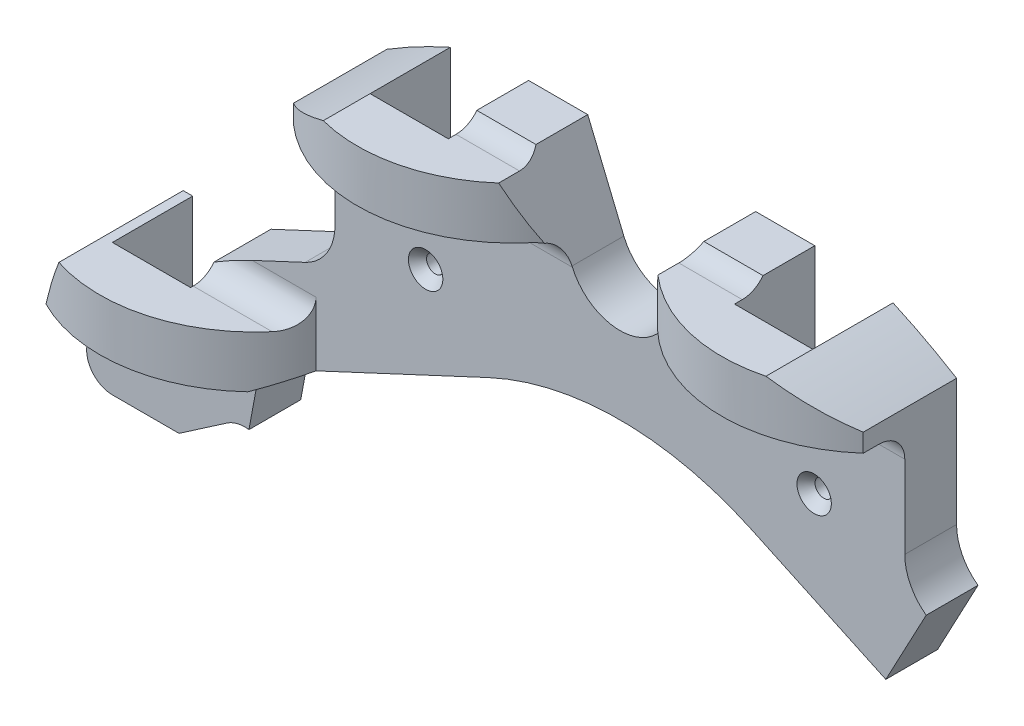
ISO-10303-21;
HEADER;
FILE_DESCRIPTION(('STEP AP214'),'2;1');
FILE_NAME('part.step','',(''),(''),'','','');
FILE_SCHEMA(('AUTOMOTIVE_DESIGN { 1 0 10303 214 1 1 1 1 }'));
ENDSEC;
DATA;
#1=APPLICATION_CONTEXT('core data for automotive mechanical design processes');
#2=APPLICATION_PROTOCOL_DEFINITION('international standard','automotive_design',2000,#1);
#3=PRODUCT_CONTEXT('',#1,'mechanical');
#4=PRODUCT('Part','Part','',(#3));
#5=PRODUCT_RELATED_PRODUCT_CATEGORY('part','',(#4));
#6=PRODUCT_DEFINITION_FORMATION('','',#4);
#7=PRODUCT_DEFINITION_CONTEXT('part definition',#1,'design');
#8=PRODUCT_DEFINITION('design','',#6,#7);
#9=PRODUCT_DEFINITION_SHAPE('','',#8);
#10=(LENGTH_UNIT() NAMED_UNIT(*) SI_UNIT(.MILLI.,.METRE.));
#11=(NAMED_UNIT(*) PLANE_ANGLE_UNIT() SI_UNIT($,.RADIAN.));
#12=(NAMED_UNIT(*) SI_UNIT($,.STERADIAN.) SOLID_ANGLE_UNIT());
#13=UNCERTAINTY_MEASURE_WITH_UNIT(LENGTH_MEASURE(1.E-05),#10,'distance_accuracy_value','');
#14=(GEOMETRIC_REPRESENTATION_CONTEXT(3) GLOBAL_UNCERTAINTY_ASSIGNED_CONTEXT((#13)) GLOBAL_UNIT_ASSIGNED_CONTEXT((#10,
#11,#12)) REPRESENTATION_CONTEXT('',''));
#15=CARTESIAN_POINT('',(0.,0.,0.));
#16=DIRECTION('',(0.,0.,1.));
#17=DIRECTION('',(1.,0.,0.));
#18=AXIS2_PLACEMENT_3D('',#15,#16,#17);
#19=CARTESIAN_POINT('',(44.6738516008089,109.110589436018,-5.715));
#20=DIRECTION('',(0.,1.,0.));
#21=DIRECTION('',(-1.,0.,0.));
#22=AXIS2_PLACEMENT_3D('',#19,#20,#21);
#23=CYLINDRICAL_SURFACE('',#22,38.1);
#24=CARTESIAN_POINT('',(44.6738516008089,182.517737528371,-5.715));
#25=DIRECTION('',(-0.923879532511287,0.382683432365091,0.));
#26=DIRECTION('',(0.38268343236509,0.923879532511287,0.));
#27=AXIS2_PLACEMENT_3D('',#24,#25,#26);
#28=ELLIPSE('',#27,99.5600979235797,38.1);
#29=CARTESIAN_POINT('',(14.1361998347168,108.793324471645,17.0679283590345));
#30=VERTEX_POINT('',#29);
#31=CARTESIAN_POINT('',(19.5281275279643,121.810589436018,22.9084617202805));
#32=VERTEX_POINT('',#31);
#33=EDGE_CURVE('E1206',#30,#32,#28,.T.);
#34=ORIENTED_EDGE('',*,*,#33,.F.);
#35=CARTESIAN_POINT('',(14.1361998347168,108.793324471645,17.0679283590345));
#36=CARTESIAN_POINT('',(14.2600750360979,108.847879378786,17.2339875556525));
#37=CARTESIAN_POINT('',(14.3864578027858,108.895010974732,17.4005422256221));
#38=CARTESIAN_POINT('',(14.6430761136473,108.974844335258,17.7329462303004));
#39=CARTESIAN_POINT('',(14.7732923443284,109.007608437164,17.8987954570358));
#40=CARTESIAN_POINT('',(15.0374979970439,109.059588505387,18.2295477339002));
#41=CARTESIAN_POINT('',(15.1714870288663,109.078805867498,18.3944508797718));
#42=CARTESIAN_POINT('',(15.4433065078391,109.10433223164,18.7233124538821));
#43=CARTESIAN_POINT('',(15.5811512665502,109.110584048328,18.8872635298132));
#44=CARTESIAN_POINT('',(15.7203582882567,109.110589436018,19.05));
#45=B_SPLINE_CURVE_WITH_KNOTS('',3,(#35,#36,#37,#38,#39,#40,#41,#42,#43,#44),.UNSPECIFIED.,.F.,
.F.,(4,2,2,2,4),(0.,0.642482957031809,1.28215005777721,1.92175124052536,2.5641674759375),.UNSPECIFIED.);
#46=CARTESIAN_POINT('',(15.7203582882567,109.110589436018,19.05));
#47=VERTEX_POINT('',#46);
#48=EDGE_CURVE('E528',#30,#47,#45,.T.);
#49=ORIENTED_EDGE('',*,*,#48,.T.);
#50=CARTESIAN_POINT('',(44.6738516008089,109.110589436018,-5.715));
#51=DIRECTION('',(0.,-1.,0.));
#52=DIRECTION('',(0.,0.,1.));
#53=AXIS2_PLACEMENT_3D('',#50,#51,#52);
#54=CIRCLE('',#53,38.1);
#55=CARTESIAN_POINT('',(69.8465142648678,109.110589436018,22.8847736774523));
#56=VERTEX_POINT('',#55);
#57=EDGE_CURVE('E1173',#56,#47,#54,.T.);
#58=ORIENTED_EDGE('',*,*,#57,.F.);
#59=DIRECTION('',(0.,1.,0.));
#60=VECTOR('',#59,1.);
#61=CARTESIAN_POINT('',(69.8465142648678,109.110589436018,22.8847736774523));
#62=LINE('',#61,#60);
#63=CARTESIAN_POINT('',(69.8465142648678,113.59439662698,22.8847736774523));
#64=VERTEX_POINT('',#63);
#65=EDGE_CURVE('E1201',#64,#56,#62,.F.);
#66=ORIENTED_EDGE('',*,*,#65,.F.);
#67=CARTESIAN_POINT('',(54.2623516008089,121.810589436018,31.1587124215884));
#68=CARTESIAN_POINT('',(54.8411459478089,121.55276704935,31.0082051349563));
#69=CARTESIAN_POINT('',(55.4151855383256,121.292098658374,30.8443847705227));
#70=CARTESIAN_POINT('',(56.5528655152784,120.765839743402,30.4907158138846));
#71=CARTESIAN_POINT('',(57.1165063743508,120.500249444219,30.300868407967));
#72=CARTESIAN_POINT('',(58.2327436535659,119.96480106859,29.8956599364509));
#73=CARTESIAN_POINT('',(58.7853362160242,119.694941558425,29.6802901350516));
#74=CARTESIAN_POINT('',(59.8784407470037,119.151867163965,29.2246785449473));
#75=CARTESIAN_POINT('',(60.4189526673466,118.878652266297,28.9844366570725));
#76=CARTESIAN_POINT('',(62.0026710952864,118.064738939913,28.2359866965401));
#77=CARTESIAN_POINT('',(63.0277155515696,117.520306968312,27.6928830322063));
#78=CARTESIAN_POINT('',(65.0222769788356,116.428596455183,26.5168366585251));
#79=CARTESIAN_POINT('',(65.9918257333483,115.881319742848,25.883946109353));
#80=CARTESIAN_POINT('',(67.4337219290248,115.044572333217,24.8461149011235));
#81=CARTESIAN_POINT('',(67.9276207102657,114.753560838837,24.4720301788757));
#82=CARTESIAN_POINT('',(68.8997194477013,114.172560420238,23.6976684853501));
#83=CARTESIAN_POINT('',(69.3778343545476,113.882582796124,23.2972762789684));
#84=CARTESIAN_POINT('',(69.8465142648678,113.59439662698,22.8847736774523));
#85=B_SPLINE_CURVE_WITH_KNOTS('',3,(#67,#68,#69,#70,#71,#72,#73,#74,#75,#76,#77,#78,#79,#80,#81,
#82,#83,#84),.UNSPECIFIED.,.F.,.F.,(4,2,2,2,2,2,2,2,4),(0.,1.95355816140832,3.90702731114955,
5.86116703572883,7.81531455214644,11.6549400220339,15.4923439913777,17.5452925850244,
19.6079258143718),.UNSPECIFIED.);
#86=CARTESIAN_POINT('',(54.2623516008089,121.810589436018,31.1587124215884));
#87=VERTEX_POINT('',#86);
#88=EDGE_CURVE('E519',#87,#64,#85,.T.);
#89=ORIENTED_EDGE('',*,*,#88,.F.);
#90=CARTESIAN_POINT('',(44.6738516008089,121.810589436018,-5.715));
#91=DIRECTION('',(0.,-1.,0.));
#92=DIRECTION('',(0.,0.,1.));
#93=AXIS2_PLACEMENT_3D('',#90,#91,#92);
#94=CIRCLE('',#93,38.1);
#95=EDGE_CURVE('E1176',#87,#32,#94,.T.);
#96=ORIENTED_EDGE('',*,*,#95,.T.);
#97=EDGE_LOOP('',(#34,#49,#58,#66,#89,#96));
#98=FACE_BOUND('',#97,.T.);
#99=ADVANCED_FACE('F33',(#98),#23,.T.);
#100=CARTESIAN_POINT('',(44.6738516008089,109.110589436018,-5.715));
#101=DIRECTION('',(0.,1.,0.));
#102=DIRECTION('',(0.,0.,1.));
#103=AXIS2_PLACEMENT_3D('',#100,#101,#102);
#104=PLANE('',#103);
#105=DIRECTION('',(0.,0.,-1.));
#106=VECTOR('',#105,1.);
#107=CARTESIAN_POINT('',(54.2623516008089,109.110589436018,12.7));
#108=LINE('',#107,#106);
#109=CARTESIAN_POINT('',(54.2623516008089,109.110589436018,19.685));
#110=VERTEX_POINT('',#109);
#111=CARTESIAN_POINT('',(54.2623516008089,109.110589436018,19.05));
#112=VERTEX_POINT('',#111);
#113=EDGE_CURVE('E1179',#110,#112,#108,.T.);
#114=ORIENTED_EDGE('',*,*,#113,.T.);
#115=DIRECTION('',(1.,0.,0.));
#116=VECTOR('',#115,1.);
#117=CARTESIAN_POINT('',(44.6738516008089,109.110589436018,19.05));
#118=LINE('',#117,#116);
#119=CARTESIAN_POINT('',(69.8465142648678,109.110589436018,19.05));
#120=VERTEX_POINT('',#119);
#121=EDGE_CURVE('E860',#112,#120,#118,.T.);
#122=ORIENTED_EDGE('',*,*,#121,.T.);
#123=DIRECTION('',(0.,0.,-1.));
#124=VECTOR('',#123,1.);
#125=CARTESIAN_POINT('',(69.8465142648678,109.110589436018,-5.715));
#126=LINE('',#125,#124);
#127=EDGE_CURVE('E833',#56,#120,#126,.T.);
#128=ORIENTED_EDGE('',*,*,#127,.F.);
#129=ORIENTED_EDGE('',*,*,#57,.T.);
#130=DIRECTION('',(1.,0.,0.));
#131=VECTOR('',#130,1.);
#132=CARTESIAN_POINT('',(44.6738516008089,109.110589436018,19.05));
#133=LINE('',#132,#131);
#134=CARTESIAN_POINT('',(35.0853516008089,109.110589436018,19.05));
#135=VERTEX_POINT('',#134);
#136=EDGE_CURVE('E857',#47,#135,#133,.T.);
#137=ORIENTED_EDGE('',*,*,#136,.T.);
#138=DIRECTION('',(0.,0.,1.));
#139=VECTOR('',#138,1.);
#140=CARTESIAN_POINT('',(35.0853516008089,109.110589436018,19.685));
#141=LINE('',#140,#139);
#142=CARTESIAN_POINT('',(35.0853516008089,109.110589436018,19.685));
#143=VERTEX_POINT('',#142);
#144=EDGE_CURVE('E1188',#135,#143,#141,.T.);
#145=ORIENTED_EDGE('',*,*,#144,.T.);
#146=DIRECTION('',(1.,0.,0.));
#147=VECTOR('',#146,1.);
#148=CARTESIAN_POINT('',(54.2623516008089,109.110589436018,19.685));
#149=LINE('',#148,#147);
#150=EDGE_CURVE('E1190',#143,#110,#149,.T.);
#151=ORIENTED_EDGE('',*,*,#150,.T.);
#152=EDGE_LOOP('',(#114,#122,#128,#129,#137,#145,#151));
#153=FACE_BOUND('',#152,.T.);
#154=ADVANCED_FACE('F503',(#153),#104,.F.);
#155=CARTESIAN_POINT('',(44.6738516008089,121.810589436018,-5.715));
#156=DIRECTION('',(0.,1.,0.));
#157=DIRECTION('',(0.,0.,1.));
#158=AXIS2_PLACEMENT_3D('',#155,#156,#157);
#159=PLANE('',#158);
#160=DIRECTION('',(0.,0.,1.));
#161=VECTOR('',#160,1.);
#162=CARTESIAN_POINT('',(35.0853516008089,121.810589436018,19.685));
#163=LINE('',#162,#161);
#164=CARTESIAN_POINT('',(35.0853516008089,121.810589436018,17.7887009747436));
#165=VERTEX_POINT('',#164);
#166=CARTESIAN_POINT('',(35.0853516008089,121.810589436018,19.685));
#167=VERTEX_POINT('',#166);
#168=EDGE_CURVE('E1180',#165,#167,#163,.T.);
#169=ORIENTED_EDGE('',*,*,#168,.F.);
#170=DIRECTION('',(1.,0.,0.));
#171=VECTOR('',#170,1.);
#172=CARTESIAN_POINT('',(19.5281275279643,121.810589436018,17.7887009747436));
#173=LINE('',#172,#171);
#174=CARTESIAN_POINT('',(19.5281275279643,121.810589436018,17.7887009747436));
#175=VERTEX_POINT('',#174);
#176=EDGE_CURVE('E839',#165,#175,#173,.F.);
#177=ORIENTED_EDGE('',*,*,#176,.T.);
#178=DIRECTION('',(0.,0.,-1.));
#179=VECTOR('',#178,1.);
#180=CARTESIAN_POINT('',(19.5281275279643,121.810589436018,32.385));
#181=LINE('',#180,#179);
#182=EDGE_CURVE('E408',#32,#175,#181,.T.);
#183=ORIENTED_EDGE('',*,*,#182,.F.);
#184=ORIENTED_EDGE('',*,*,#95,.F.);
#185=DIRECTION('',(0.,0.,-1.));
#186=VECTOR('',#185,1.);
#187=CARTESIAN_POINT('',(54.2623516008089,121.810589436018,32.385));
#188=LINE('',#187,#186);
#189=CARTESIAN_POINT('',(54.2623516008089,121.810589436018,19.685));
#190=VERTEX_POINT('',#189);
#191=EDGE_CURVE('E830',#87,#190,#188,.T.);
#192=ORIENTED_EDGE('',*,*,#191,.T.);
#193=DIRECTION('',(1.,0.,0.));
#194=VECTOR('',#193,1.);
#195=CARTESIAN_POINT('',(54.2623516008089,121.810589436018,19.685));
#196=LINE('',#195,#194);
#197=EDGE_CURVE('E1182',#167,#190,#196,.T.);
#198=ORIENTED_EDGE('',*,*,#197,.F.);
#199=EDGE_LOOP('',(#169,#177,#183,#184,#192,#198));
#200=FACE_BOUND('',#199,.T.);
#201=ADVANCED_FACE('F509',(#200),#159,.T.);
#202=CARTESIAN_POINT('',(47.625,84.3170254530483,-6.35));
#203=DIRECTION('',(0.,0.,-1.));
#204=DIRECTION('',(1.,0.,0.));
#205=AXIS2_PLACEMENT_3D('',#202,#203,#204);
#206=PLANE('',#205);
#207=CARTESIAN_POINT('',(47.625,84.3170254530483,-6.35));
#208=DIRECTION('',(0.,0.,1.));
#209=DIRECTION('',(1.,0.,0.));
#210=AXIS2_PLACEMENT_3D('',#207,#208,#209);
#211=CIRCLE('',#210,9.525);
#212=CARTESIAN_POINT('',(57.15,84.3170254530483,-6.35));
#213=VERTEX_POINT('',#212);
#214=EDGE_CURVE('E1151',#213,#213,#211,.T.);
#215=ORIENTED_EDGE('',*,*,#214,.F.);
#216=EDGE_LOOP('',(#215));
#217=FACE_BOUND('',#216,.T.);
#218=CARTESIAN_POINT('',(47.625,84.3170254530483,-6.35));
#219=DIRECTION('',(0.,0.,1.));
#220=DIRECTION('',(1.,0.,0.));
#221=AXIS2_PLACEMENT_3D('',#218,#219,#220);
#222=CIRCLE('',#221,2.15265);
#223=CARTESIAN_POINT('',(49.77765,84.3170254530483,-6.35));
#224=VERTEX_POINT('',#223);
#225=EDGE_CURVE('E1185',#224,#224,#222,.T.);
#226=ORIENTED_EDGE('',*,*,#225,.T.);
#227=EDGE_LOOP('',(#226));
#228=FACE_BOUND('',#227,.T.);
#229=ADVANCED_FACE('F1316',(#217,#228),#206,.T.);
#230=CARTESIAN_POINT('',(0.,0.,12.7));
#231=DIRECTION('',(0.,0.,1.));
#232=DIRECTION('',(1.,0.,0.));
#233=AXIS2_PLACEMENT_3D('',#230,#231,#232);
#234=PLANE('',#233);
#235=DIRECTION('',(-0.470255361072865,-0.882530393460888,0.));
#236=VECTOR('',#235,1.);
#237=CARTESIAN_POINT('',(28.50064449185,-15.1865374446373,12.7));
#238=LINE('',#237,#236);
#239=CARTESIAN_POINT('',(75.0969233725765,72.2609128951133,12.7));
#240=VERTEX_POINT('',#239);
#241=CARTESIAN_POINT('',(65.1943776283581,53.6767598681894,12.7));
#242=VERTEX_POINT('',#241);
#243=EDGE_CURVE('E404',#240,#242,#238,.T.);
#244=ORIENTED_EDGE('',*,*,#243,.F.);
#245=CARTESIAN_POINT('',(82.5465142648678,82.5465142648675,12.7));
#246=DIRECTION('',(0.,0.,1.));
#247=DIRECTION('',(-1.,0.,0.));
#248=AXIS2_PLACEMENT_3D('',#245,#246,#247);
#249=CIRCLE('',#248,12.7);
#250=CARTESIAN_POINT('',(69.8465142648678,82.5465142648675,12.7));
#251=VERTEX_POINT('',#250);
#252=EDGE_CURVE('E1153',#251,#240,#249,.T.);
#253=ORIENTED_EDGE('',*,*,#252,.F.);
#254=DIRECTION('',(0.,-1.,0.));
#255=VECTOR('',#254,1.);
#256=CARTESIAN_POINT('',(69.8465142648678,82.5465142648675,12.7));
#257=LINE('',#256,#255);
#258=CARTESIAN_POINT('',(69.8465142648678,102.760589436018,12.7));
#259=VERTEX_POINT('',#258);
#260=EDGE_CURVE('E438',#259,#251,#257,.T.);
#261=ORIENTED_EDGE('',*,*,#260,.F.);
#262=DIRECTION('',(1.,0.,0.));
#263=VECTOR('',#262,1.);
#264=CARTESIAN_POINT('',(0.,102.760589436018,12.7));
#265=LINE('',#264,#263);
#266=CARTESIAN_POINT('',(54.2623516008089,102.760589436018,12.7));
#267=VERTEX_POINT('',#266);
#268=EDGE_CURVE('E849',#259,#267,#265,.F.);
#269=ORIENTED_EDGE('',*,*,#268,.T.);
#270=DIRECTION('',(0.,1.,0.));
#271=VECTOR('',#270,1.);
#272=CARTESIAN_POINT('',(54.2623516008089,121.810589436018,12.7));
#273=LINE('',#272,#271);
#274=CARTESIAN_POINT('',(54.2623516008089,97.6922184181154,12.7));
#275=VERTEX_POINT('',#274);
#276=EDGE_CURVE('E434',#275,#267,#273,.T.);
#277=ORIENTED_EDGE('',*,*,#276,.F.);
#278=DIRECTION('',(1.,0.,0.));
#279=VECTOR('',#278,1.);
#280=CARTESIAN_POINT('',(54.2623516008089,97.6922184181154,12.7));
#281=LINE('',#280,#279);
#282=CARTESIAN_POINT('',(35.0853516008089,97.6922184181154,12.7));
#283=VERTEX_POINT('',#282);
#284=EDGE_CURVE('E1162',#283,#275,#281,.T.);
#285=ORIENTED_EDGE('',*,*,#284,.F.);
#286=DIRECTION('',(0.,-1.,0.));
#287=VECTOR('',#286,1.);
#288=CARTESIAN_POINT('',(35.0853516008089,97.6922184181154,12.7));
#289=LINE('',#288,#287);
#290=CARTESIAN_POINT('',(35.0853516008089,102.760589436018,12.7));
#291=VERTEX_POINT('',#290);
#292=EDGE_CURVE('E1160',#291,#283,#289,.T.);
#293=ORIENTED_EDGE('',*,*,#292,.F.);
#294=DIRECTION('',(1.,0.,0.));
#295=VECTOR('',#294,1.);
#296=CARTESIAN_POINT('',(0.,102.760589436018,12.7));
#297=LINE('',#296,#295);
#298=CARTESIAN_POINT('',(11.6346600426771,102.760589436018,12.7));
#299=VERTEX_POINT('',#298);
#300=EDGE_CURVE('E847',#291,#299,#297,.F.);
#301=ORIENTED_EDGE('',*,*,#300,.T.);
#302=CARTESIAN_POINT('',(0.,107.852218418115,12.7));
#303=DIRECTION('',(0.,0.,-1.));
#304=DIRECTION('',(1.,0.,0.));
#305=AXIS2_PLACEMENT_3D('',#302,#303,#304);
#306=CIRCLE('',#305,12.7);
#307=CARTESIAN_POINT('',(-11.6346600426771,102.760589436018,12.7));
#308=VERTEX_POINT('',#307);
#309=EDGE_CURVE('E959',#299,#308,#306,.T.);
#310=ORIENTED_EDGE('',*,*,#309,.T.);
#311=DIRECTION('',(-1.,0.,0.));
#312=VECTOR('',#311,1.);
#313=CARTESIAN_POINT('',(0.,102.760589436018,12.7));
#314=LINE('',#313,#312);
#315=CARTESIAN_POINT('',(-35.0853516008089,102.760589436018,12.7));
#316=VERTEX_POINT('',#315);
#317=EDGE_CURVE('E844',#308,#316,#314,.T.);
#318=ORIENTED_EDGE('',*,*,#317,.T.);
#319=DIRECTION('',(0.,-1.,0.));
#320=VECTOR('',#319,1.);
#321=CARTESIAN_POINT('',(-35.0853516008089,97.6922184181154,12.7));
#322=LINE('',#321,#320);
#323=CARTESIAN_POINT('',(-35.0853516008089,97.6922184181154,12.7));
#324=VERTEX_POINT('',#323);
#325=EDGE_CURVE('E965',#316,#324,#322,.T.);
#326=ORIENTED_EDGE('',*,*,#325,.T.);
#327=DIRECTION('',(-1.,0.,0.));
#328=VECTOR('',#327,1.);
#329=CARTESIAN_POINT('',(-54.2623516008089,97.6922184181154,12.7));
#330=LINE('',#329,#328);
#331=CARTESIAN_POINT('',(-54.2623516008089,97.6922184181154,12.7));
#332=VERTEX_POINT('',#331);
#333=EDGE_CURVE('E967',#324,#332,#330,.T.);
#334=ORIENTED_EDGE('',*,*,#333,.T.);
#335=DIRECTION('',(0.,1.,0.));
#336=VECTOR('',#335,1.);
#337=CARTESIAN_POINT('',(-54.2623516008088,121.810589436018,12.7));
#338=LINE('',#337,#336);
#339=CARTESIAN_POINT('',(-54.2623516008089,102.760589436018,12.7));
#340=VERTEX_POINT('',#339);
#341=EDGE_CURVE('E764',#332,#340,#338,.T.);
#342=ORIENTED_EDGE('',*,*,#341,.T.);
#343=DIRECTION('',(-1.,0.,0.));
#344=VECTOR('',#343,1.);
#345=CARTESIAN_POINT('',(0.,102.760589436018,12.7));
#346=LINE('',#345,#344);
#347=CARTESIAN_POINT('',(-69.8465142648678,102.760589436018,12.7));
#348=VERTEX_POINT('',#347);
#349=EDGE_CURVE('E841',#340,#348,#346,.T.);
#350=ORIENTED_EDGE('',*,*,#349,.T.);
#351=DIRECTION('',(0.,-1.,0.));
#352=VECTOR('',#351,1.);
#353=CARTESIAN_POINT('',(-69.8465142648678,82.5465142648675,12.7));
#354=LINE('',#353,#352);
#355=CARTESIAN_POINT('',(-69.8465142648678,82.5465142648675,12.7));
#356=VERTEX_POINT('',#355);
#357=EDGE_CURVE('E759',#348,#356,#354,.T.);
#358=ORIENTED_EDGE('',*,*,#357,.T.);
#359=CARTESIAN_POINT('',(-82.5465142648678,82.5465142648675,12.7));
#360=DIRECTION('',(0.,0.,-1.));
#361=DIRECTION('',(1.,0.,0.));
#362=AXIS2_PLACEMENT_3D('',#359,#360,#361);
#363=CIRCLE('',#362,12.7);
#364=CARTESIAN_POINT('',(-77.1699830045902,71.0407369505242,12.7));
#365=VERTEX_POINT('',#364);
#366=EDGE_CURVE('E898',#356,#365,#363,.T.);
#367=ORIENTED_EDGE('',*,*,#366,.T.);
#368=DIRECTION('',(-0.905966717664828,-0.423348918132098,0.));
#369=VECTOR('',#368,1.);
#370=CARTESIAN_POINT('',(-98.2637184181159,61.1838516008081,12.7));
#371=LINE('',#370,#369);
#372=CARTESIAN_POINT('',(-90.1352041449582,64.9822226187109,12.7));
#373=VERTEX_POINT('',#372);
#374=EDGE_CURVE('E890',#365,#373,#371,.T.);
#375=ORIENTED_EDGE('',*,*,#374,.T.);
#376=DIRECTION('',(-1.,0.,0.));
#377=VECTOR('',#376,1.);
#378=CARTESIAN_POINT('',(0.,64.9822226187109,12.7));
#379=LINE('',#378,#377);
#380=CARTESIAN_POINT('',(-74.4980916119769,64.9822226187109,12.7));
#381=VERTEX_POINT('',#380);
#382=EDGE_CURVE('E851',#373,#381,#379,.F.);
#383=ORIENTED_EDGE('',*,*,#382,.T.);
#384=DIRECTION('',(0.,1.,0.));
#385=VECTOR('',#384,1.);
#386=CARTESIAN_POINT('',(-74.4980916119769,45.9322226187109,12.7));
#387=LINE('',#386,#385);
#388=CARTESIAN_POINT('',(-74.4980916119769,49.3383667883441,12.7));
#389=VERTEX_POINT('',#388);
#390=EDGE_CURVE('E907',#389,#381,#387,.T.);
#391=ORIENTED_EDGE('',*,*,#390,.F.);
#392=DIRECTION('',(0.906307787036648,0.422618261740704,0.));
#393=VECTOR('',#392,1.);
#394=CARTESIAN_POINT('',(-85.3293669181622,44.2876601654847,12.7));
#395=LINE('',#394,#393);
#396=CARTESIAN_POINT('',(-32.2035115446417,69.0606533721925,12.7));
#397=VERTEX_POINT('',#396);
#398=EDGE_CURVE('E954',#389,#397,#395,.T.);
#399=ORIENTED_EDGE('',*,*,#398,.T.);
#400=CARTESIAN_POINT('',(0.,0.,12.7));
#401=DIRECTION('',(0.,0.,-1.));
#402=DIRECTION('',(1.,0.,0.));
#403=AXIS2_PLACEMENT_3D('',#400,#401,#402);
#404=CIRCLE('',#403,76.2);
#405=CARTESIAN_POINT('',(32.2035115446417,69.0606533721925,12.7));
#406=VERTEX_POINT('',#405);
#407=EDGE_CURVE('E956',#397,#406,#404,.T.);
#408=ORIENTED_EDGE('',*,*,#407,.T.);
#409=DIRECTION('',(-0.906307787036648,0.422618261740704,0.));
#410=VECTOR('',#409,1.);
#411=CARTESIAN_POINT('',(85.3293669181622,44.2876601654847,12.7));
#412=LINE('',#411,#410);
#413=EDGE_CURVE('E1156',#242,#406,#412,.T.);
#414=ORIENTED_EDGE('',*,*,#413,.F.);
#415=EDGE_LOOP('',(#244,#253,#261,#269,#277,#285,#293,#301,#310,#318,#326,#334,#342,#350,#358,
#367,#375,#383,#391,#399,#408,#414));
#416=FACE_BOUND('',#415,.T.);
#417=CARTESIAN_POINT('',(47.625,84.3170254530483,12.7));
#418=DIRECTION('',(0.,0.,1.));
#419=DIRECTION('',(1.,0.,0.));
#420=AXIS2_PLACEMENT_3D('',#417,#418,#419);
#421=CIRCLE('',#420,4.2164);
#422=CARTESIAN_POINT('',(51.8414,84.3170254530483,12.7));
#423=VERTEX_POINT('',#422);
#424=EDGE_CURVE('E1199',#423,#423,#421,.T.);
#425=ORIENTED_EDGE('',*,*,#424,.F.);
#426=EDGE_LOOP('',(#425));
#427=FACE_BOUND('',#426,.T.);
#428=CARTESIAN_POINT('',(-47.625,84.3170254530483,12.7));
#429=DIRECTION('',(0.,0.,1.));
#430=DIRECTION('',(1.,0.,0.));
#431=AXIS2_PLACEMENT_3D('',#428,#429,#430);
#432=CIRCLE('',#431,4.2164);
#433=CARTESIAN_POINT('',(-43.4086,84.3170254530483,12.7));
#434=VERTEX_POINT('',#433);
#435=EDGE_CURVE('E1294',#434,#434,#432,.T.);
#436=ORIENTED_EDGE('',*,*,#435,.F.);
#437=EDGE_LOOP('',(#436));
#438=FACE_BOUND('',#437,.T.);
#439=ADVANCED_FACE('F893',(#416,#427,#438),#234,.T.);
#440=CARTESIAN_POINT('',(-47.625,84.3170254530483,-6.35));
#441=DIRECTION('',(0.,0.,-1.));
#442=DIRECTION('',(-1.,0.,0.));
#443=AXIS2_PLACEMENT_3D('',#440,#441,#442);
#444=PLANE('',#443);
#445=CARTESIAN_POINT('',(-47.625,84.3170254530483,-6.35));
#446=DIRECTION('',(0.,0.,-1.));
#447=DIRECTION('',(-1.,0.,0.));
#448=AXIS2_PLACEMENT_3D('',#445,#446,#447);
#449=CIRCLE('',#448,9.525);
#450=CARTESIAN_POINT('',(-57.15,84.3170254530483,-6.35));
#451=VERTEX_POINT('',#450);
#452=EDGE_CURVE('E925',#451,#451,#449,.T.);
#453=ORIENTED_EDGE('',*,*,#452,.T.);
#454=EDGE_LOOP('',(#453));
#455=FACE_BOUND('',#454,.T.);
#456=CARTESIAN_POINT('',(-47.625,84.3170254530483,-6.35));
#457=DIRECTION('',(0.,0.,1.));
#458=DIRECTION('',(1.,0.,0.));
#459=AXIS2_PLACEMENT_3D('',#456,#457,#458);
#460=CIRCLE('',#459,2.15265);
#461=CARTESIAN_POINT('',(-45.47235,84.3170254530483,-6.35));
#462=VERTEX_POINT('',#461);
#463=EDGE_CURVE('E1288',#462,#462,#460,.T.);
#464=ORIENTED_EDGE('',*,*,#463,.T.);
#465=EDGE_LOOP('',(#464));
#466=FACE_BOUND('',#465,.T.);
#467=ADVANCED_FACE('F651',(#455,#466),#444,.T.);
#468=DIRECTION('',(0.182822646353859,0.983145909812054,0.));
#469=VECTOR('',#468,1.);
#470=CARTESIAN_POINT('',(-90.9457216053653,28.6317971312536,12.7));
#471=LINE('',#470,#469);
#472=CARTESIAN_POINT('',(-90.9457216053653,28.6317971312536,12.7));
#473=VERTEX_POINT('',#472);
#474=CARTESIAN_POINT('',(-88.9094157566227,39.5822226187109,12.7));
#475=VERTEX_POINT('',#474);
#476=EDGE_CURVE('E951',#473,#475,#471,.T.);
#477=ORIENTED_EDGE('',*,*,#476,.T.);
#478=DIRECTION('',(-1.,0.,0.));
#479=VECTOR('',#478,1.);
#480=CARTESIAN_POINT('',(0.,39.5822226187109,12.7));
#481=LINE('',#480,#479);
#482=CARTESIAN_POINT('',(-98.2637184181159,39.5822226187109,12.7));
#483=VERTEX_POINT('',#482);
#484=EDGE_CURVE('E870',#475,#483,#481,.T.);
#485=ORIENTED_EDGE('',*,*,#484,.T.);
#486=DIRECTION('',(0.,-1.,0.));
#487=VECTOR('',#486,1.);
#488=CARTESIAN_POINT('',(-98.2637184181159,34.5138516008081,12.7));
#489=LINE('',#488,#487);
#490=CARTESIAN_POINT('',(-98.2637184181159,34.5138516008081,12.7));
#491=VERTEX_POINT('',#490);
#492=EDGE_CURVE('E900',#483,#491,#489,.T.);
#493=ORIENTED_EDGE('',*,*,#492,.T.);
#494=DIRECTION('',(-1.,0.,0.));
#495=VECTOR('',#494,1.);
#496=CARTESIAN_POINT('',(-117.440718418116,34.5138516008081,12.7));
#497=LINE('',#496,#495);
#498=CARTESIAN_POINT('',(-117.440718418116,34.5138516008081,12.7));
#499=VERTEX_POINT('',#498);
#500=EDGE_CURVE('E936',#491,#499,#497,.T.);
#501=ORIENTED_EDGE('',*,*,#500,.T.);
#502=DIRECTION('',(0.,1.,0.));
#503=VECTOR('',#502,1.);
#504=CARTESIAN_POINT('',(-117.440718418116,58.6322226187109,12.7));
#505=LINE('',#504,#503);
#506=CARTESIAN_POINT('',(-117.440718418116,39.5822226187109,12.7));
#507=VERTEX_POINT('',#506);
#508=EDGE_CURVE('E938',#499,#507,#505,.T.);
#509=ORIENTED_EDGE('',*,*,#508,.T.);
#510=DIRECTION('',(-1.,0.,0.));
#511=VECTOR('',#510,1.);
#512=CARTESIAN_POINT('',(0.,39.5822226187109,12.7));
#513=LINE('',#512,#511);
#514=CARTESIAN_POINT('',(-127.339978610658,39.5822226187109,12.7));
#515=VERTEX_POINT('',#514);
#516=EDGE_CURVE('E867',#507,#515,#513,.T.);
#517=ORIENTED_EDGE('',*,*,#516,.T.);
#518=CARTESIAN_POINT('',(0.,0.,12.7));
#519=DIRECTION('',(0.,0.,1.));
#520=DIRECTION('',(1.,0.,0.));
#521=AXIS2_PLACEMENT_3D('',#518,#519,#520);
#522=CIRCLE('',#521,133.35);
#523=CARTESIAN_POINT('',(-130.607584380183,26.9050441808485,12.7));
#524=VERTEX_POINT('',#523);
#525=EDGE_CURVE('E941',#515,#524,#522,.T.);
#526=ORIENTED_EDGE('',*,*,#525,.T.);
#527=CARTESIAN_POINT('',(-124.388175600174,25.6238516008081,12.7));
#528=DIRECTION('',(0.,0.,1.));
#529=DIRECTION('',(-1.,0.,0.));
#530=AXIS2_PLACEMENT_3D('',#527,#528,#529);
#531=CIRCLE('',#530,6.35000000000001);
#532=CARTESIAN_POINT('',(-124.388175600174,19.2738516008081,12.7));
#533=VERTEX_POINT('',#532);
#534=EDGE_CURVE('E943',#524,#533,#531,.T.);
#535=ORIENTED_EDGE('',*,*,#534,.T.);
#536=DIRECTION('',(1.,0.,0.));
#537=VECTOR('',#536,1.);
#538=CARTESIAN_POINT('',(-124.388175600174,19.2738516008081,12.7));
#539=LINE('',#538,#537);
#540=CARTESIAN_POINT('',(-108.084061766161,19.2738516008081,12.7));
#541=VERTEX_POINT('',#540);
#542=EDGE_CURVE('E945',#533,#541,#539,.T.);
#543=ORIENTED_EDGE('',*,*,#542,.T.);
#544=DIRECTION('',(0.824464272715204,0.565914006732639,0.));
#545=VECTOR('',#544,1.);
#546=CARTESIAN_POINT('',(-108.084061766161,19.2738516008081,12.7));
#547=LINE('',#546,#545);
#548=CARTESIAN_POINT('',(-96.2959462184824,27.3652388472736,12.7));
#549=VERTEX_POINT('',#548);
#550=EDGE_CURVE('E947',#541,#549,#547,.T.);
#551=ORIENTED_EDGE('',*,*,#550,.T.);
#552=CARTESIAN_POINT('',(-91.9836814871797,21.0828210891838,12.7));
#553=DIRECTION('',(0.,0.,-1.));
#554=DIRECTION('',(1.,0.,0.));
#555=AXIS2_PLACEMENT_3D('',#552,#553,#554);
#556=CIRCLE('',#555,7.62);
#557=EDGE_CURVE('E949',#549,#473,#556,.T.);
#558=ORIENTED_EDGE('',*,*,#557,.T.);
#559=EDGE_LOOP('',(#477,#485,#493,#501,#509,#517,#526,#535,#543,#551,#558));
#560=FACE_BOUND('',#559,.T.);
#561=ADVANCED_FACE('F987',(#560),#234,.T.);
#562=CARTESIAN_POINT('',(0.,0.,0.));
#563=DIRECTION('',(0.,0.,1.));
#564=DIRECTION('',(1.,0.,0.));
#565=AXIS2_PLACEMENT_3D('',#562,#563,#564);
#566=PLANE('',#565);
#567=CARTESIAN_POINT('',(-47.625,84.3170254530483,0.));
#568=DIRECTION('',(0.,0.,1.));
#569=DIRECTION('',(1.,0.,0.));
#570=AXIS2_PLACEMENT_3D('',#567,#568,#569);
#571=CIRCLE('',#570,12.7);
#572=CARTESIAN_POINT('',(-34.925,84.3170254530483,0.));
#573=VERTEX_POINT('',#572);
#574=EDGE_CURVE('E1086',#573,#573,#571,.T.);
#575=ORIENTED_EDGE('',*,*,#574,.T.);
#576=EDGE_LOOP('',(#575));
#577=FACE_BOUND('',#576,.T.);
#578=CARTESIAN_POINT('',(47.625,84.3170254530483,0.));
#579=DIRECTION('',(0.,0.,1.));
#580=DIRECTION('',(1.,0.,0.));
#581=AXIS2_PLACEMENT_3D('',#578,#579,#580);
#582=CIRCLE('',#581,12.7);
#583=CARTESIAN_POINT('',(60.325,84.3170254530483,0.));
#584=VERTEX_POINT('',#583);
#585=EDGE_CURVE('E1083',#584,#584,#582,.T.);
#586=ORIENTED_EDGE('',*,*,#585,.T.);
#587=EDGE_LOOP('',(#586));
#588=FACE_BOUND('',#587,.T.);
#589=CARTESIAN_POINT('',(82.5465142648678,82.5465142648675,0.));
#590=DIRECTION('',(0.,0.,1.));
#591=DIRECTION('',(-1.,0.,0.));
#592=AXIS2_PLACEMENT_3D('',#589,#590,#591);
#593=CIRCLE('',#592,12.7);
#594=CARTESIAN_POINT('',(69.8465142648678,82.5465142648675,0.));
#595=VERTEX_POINT('',#594);
#596=CARTESIAN_POINT('',(75.0969233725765,72.2609128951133,0.));
#597=VERTEX_POINT('',#596);
#598=EDGE_CURVE('E418',#595,#597,#593,.T.);
#599=ORIENTED_EDGE('',*,*,#598,.T.);
#600=DIRECTION('',(0.470255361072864,0.882530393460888,0.));
#601=VECTOR('',#600,1.);
#602=CARTESIAN_POINT('',(78.2087807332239,78.1009498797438,0.));
#603=LINE('',#602,#601);
#604=CARTESIAN_POINT('',(65.1943776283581,53.6767598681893,0.));
#605=VERTEX_POINT('',#604);
#606=EDGE_CURVE('E47',#605,#597,#603,.T.);
#607=ORIENTED_EDGE('',*,*,#606,.F.);
#608=DIRECTION('',(-0.906307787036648,0.422618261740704,0.));
#609=VECTOR('',#608,1.);
#610=CARTESIAN_POINT('',(85.3293669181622,44.2876601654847,0.));
#611=LINE('',#610,#609);
#612=CARTESIAN_POINT('',(32.2035115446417,69.0606533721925,0.));
#613=VERTEX_POINT('',#612);
#614=EDGE_CURVE('E414',#605,#613,#611,.T.);
#615=ORIENTED_EDGE('',*,*,#614,.T.);
#616=CARTESIAN_POINT('',(0.,0.,0.));
#617=DIRECTION('',(0.,0.,-1.));
#618=DIRECTION('',(1.,0.,0.));
#619=AXIS2_PLACEMENT_3D('',#616,#617,#618);
#620=CIRCLE('',#619,76.2);
#621=CARTESIAN_POINT('',(-32.2035115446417,69.0606533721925,0.));
#622=VERTEX_POINT('',#621);
#623=EDGE_CURVE('E745',#622,#613,#620,.T.);
#624=ORIENTED_EDGE('',*,*,#623,.F.);
#625=DIRECTION('',(0.906307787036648,0.422618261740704,0.));
#626=VECTOR('',#625,1.);
#627=CARTESIAN_POINT('',(-85.3293669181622,44.2876601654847,0.));
#628=LINE('',#627,#626);
#629=CARTESIAN_POINT('',(-85.3293669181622,44.2876601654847,0.));
#630=VERTEX_POINT('',#629);
#631=EDGE_CURVE('E743',#630,#622,#628,.T.);
#632=ORIENTED_EDGE('',*,*,#631,.F.);
#633=CARTESIAN_POINT('',(-82.6457409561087,38.532605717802,0.));
#634=DIRECTION('',(0.,0.,-1.));
#635=DIRECTION('',(-1.,0.,0.));
#636=AXIS2_PLACEMENT_3D('',#633,#634,#635);
#637=CIRCLE('',#636,6.35000000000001);
#638=CARTESIAN_POINT('',(-88.8887174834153,39.693529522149,0.));
#639=VERTEX_POINT('',#638);
#640=EDGE_CURVE('E741',#639,#630,#637,.T.);
#641=ORIENTED_EDGE('',*,*,#640,.F.);
#642=DIRECTION('',(0.182822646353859,0.983145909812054,0.));
#643=VECTOR('',#642,1.);
#644=CARTESIAN_POINT('',(-90.9457216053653,28.6317971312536,0.));
#645=LINE('',#644,#643);
#646=CARTESIAN_POINT('',(-90.9457216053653,28.6317971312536,0.));
#647=VERTEX_POINT('',#646);
#648=EDGE_CURVE('E739',#647,#639,#645,.T.);
#649=ORIENTED_EDGE('',*,*,#648,.F.);
#650=CARTESIAN_POINT('',(-91.9836814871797,21.0828210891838,0.));
#651=DIRECTION('',(0.,0.,-1.));
#652=DIRECTION('',(1.,0.,0.));
#653=AXIS2_PLACEMENT_3D('',#650,#651,#652);
#654=CIRCLE('',#653,7.62);
#655=CARTESIAN_POINT('',(-96.2959462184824,27.3652388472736,0.));
#656=VERTEX_POINT('',#655);
#657=EDGE_CURVE('E737',#656,#647,#654,.T.);
#658=ORIENTED_EDGE('',*,*,#657,.F.);
#659=DIRECTION('',(0.824464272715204,0.565914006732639,0.));
#660=VECTOR('',#659,1.);
#661=CARTESIAN_POINT('',(-108.084061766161,19.2738516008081,0.));
#662=LINE('',#661,#660);
#663=CARTESIAN_POINT('',(-108.084061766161,19.2738516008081,0.));
#664=VERTEX_POINT('',#663);
#665=EDGE_CURVE('E735',#664,#656,#662,.T.);
#666=ORIENTED_EDGE('',*,*,#665,.F.);
#667=DIRECTION('',(1.,0.,0.));
#668=VECTOR('',#667,1.);
#669=CARTESIAN_POINT('',(-124.388175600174,19.2738516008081,0.));
#670=LINE('',#669,#668);
#671=CARTESIAN_POINT('',(-124.388175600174,19.2738516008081,0.));
#672=VERTEX_POINT('',#671);
#673=EDGE_CURVE('E733',#672,#664,#670,.T.);
#674=ORIENTED_EDGE('',*,*,#673,.F.);
#675=CARTESIAN_POINT('',(-124.388175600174,25.6238516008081,0.));
#676=DIRECTION('',(0.,0.,1.));
#677=DIRECTION('',(-1.,0.,0.));
#678=AXIS2_PLACEMENT_3D('',#675,#676,#677);
#679=CIRCLE('',#678,6.35000000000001);
#680=CARTESIAN_POINT('',(-130.607584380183,26.9050441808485,0.));
#681=VERTEX_POINT('',#680);
#682=EDGE_CURVE('E728',#681,#672,#679,.T.);
#683=ORIENTED_EDGE('',*,*,#682,.F.);
#684=CARTESIAN_POINT('',(0.,0.,0.));
#685=DIRECTION('',(0.,0.,1.));
#686=DIRECTION('',(1.,0.,0.));
#687=AXIS2_PLACEMENT_3D('',#684,#685,#686);
#688=CIRCLE('',#687,133.35);
#689=CARTESIAN_POINT('',(-119.768464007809,58.6322226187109,0.));
#690=VERTEX_POINT('',#689);
#691=EDGE_CURVE('E725',#690,#681,#688,.T.);
#692=ORIENTED_EDGE('',*,*,#691,.F.);
#693=DIRECTION('',(-1.,0.,0.));
#694=VECTOR('',#693,1.);
#695=CARTESIAN_POINT('',(-117.440718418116,58.6322226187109,0.));
#696=LINE('',#695,#694);
#697=CARTESIAN_POINT('',(-117.440718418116,58.6322226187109,0.));
#698=VERTEX_POINT('',#697);
#699=EDGE_CURVE('E720',#698,#690,#696,.T.);
#700=ORIENTED_EDGE('',*,*,#699,.F.);
#701=DIRECTION('',(0.,1.,0.));
#702=VECTOR('',#701,1.);
#703=CARTESIAN_POINT('',(-117.440718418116,58.6322226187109,0.));
#704=LINE('',#703,#702);
#705=CARTESIAN_POINT('',(-117.440718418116,34.5138516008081,0.));
#706=VERTEX_POINT('',#705);
#707=EDGE_CURVE('E712',#706,#698,#704,.T.);
#708=ORIENTED_EDGE('',*,*,#707,.F.);
#709=DIRECTION('',(-1.,0.,0.));
#710=VECTOR('',#709,1.);
#711=CARTESIAN_POINT('',(-117.440718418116,34.5138516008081,0.));
#712=LINE('',#711,#710);
#713=CARTESIAN_POINT('',(-98.2637184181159,34.5138516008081,0.));
#714=VERTEX_POINT('',#713);
#715=EDGE_CURVE('E721',#714,#706,#712,.T.);
#716=ORIENTED_EDGE('',*,*,#715,.F.);
#717=DIRECTION('',(0.,-1.,0.));
#718=VECTOR('',#717,1.);
#719=CARTESIAN_POINT('',(-98.2637184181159,34.5138516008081,0.));
#720=LINE('',#719,#718);
#721=CARTESIAN_POINT('',(-98.2637184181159,61.1838516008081,0.));
#722=VERTEX_POINT('',#721);
#723=EDGE_CURVE('E979',#722,#714,#720,.T.);
#724=ORIENTED_EDGE('',*,*,#723,.F.);
#725=DIRECTION('',(-0.905966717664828,-0.423348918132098,0.));
#726=VECTOR('',#725,1.);
#727=CARTESIAN_POINT('',(-98.2637184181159,61.1838516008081,0.));
#728=LINE('',#727,#726);
#729=CARTESIAN_POINT('',(-77.1699830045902,71.0407369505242,0.));
#730=VERTEX_POINT('',#729);
#731=EDGE_CURVE('E977',#730,#722,#728,.T.);
#732=ORIENTED_EDGE('',*,*,#731,.F.);
#733=CARTESIAN_POINT('',(-82.5465142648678,82.5465142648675,0.));
#734=DIRECTION('',(0.,0.,-1.));
#735=DIRECTION('',(1.,0.,0.));
#736=AXIS2_PLACEMENT_3D('',#733,#734,#735);
#737=CIRCLE('',#736,12.7);
#738=CARTESIAN_POINT('',(-69.8465142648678,82.5465142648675,0.));
#739=VERTEX_POINT('',#738);
#740=EDGE_CURVE('E975',#739,#730,#737,.T.);
#741=ORIENTED_EDGE('',*,*,#740,.F.);
#742=DIRECTION('',(0.,-1.,0.));
#743=VECTOR('',#742,1.);
#744=CARTESIAN_POINT('',(-69.8465142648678,82.5465142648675,0.));
#745=LINE('',#744,#743);
#746=CARTESIAN_POINT('',(-69.8465142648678,113.59439662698,0.));
#747=VERTEX_POINT('',#746);
#748=EDGE_CURVE('E973',#747,#739,#745,.T.);
#749=ORIENTED_EDGE('',*,*,#748,.F.);
#750=CARTESIAN_POINT('',(0.,0.,0.));
#751=DIRECTION('',(0.,0.,1.));
#752=DIRECTION('',(1.,0.,0.));
#753=AXIS2_PLACEMENT_3D('',#750,#751,#752);
#754=CIRCLE('',#753,133.35);
#755=CARTESIAN_POINT('',(-54.2623516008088,121.810589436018,0.));
#756=VERTEX_POINT('',#755);
#757=EDGE_CURVE('E932',#756,#747,#754,.T.);
#758=ORIENTED_EDGE('',*,*,#757,.F.);
#759=DIRECTION('',(0.,1.,0.));
#760=VECTOR('',#759,1.);
#761=CARTESIAN_POINT('',(-54.2623516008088,121.810589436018,0.));
#762=LINE('',#761,#760);
#763=CARTESIAN_POINT('',(-54.2623516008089,97.6922184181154,0.));
#764=VERTEX_POINT('',#763);
#765=EDGE_CURVE('E757',#764,#756,#762,.T.);
#766=ORIENTED_EDGE('',*,*,#765,.F.);
#767=DIRECTION('',(-1.,0.,0.));
#768=VECTOR('',#767,1.);
#769=CARTESIAN_POINT('',(-54.2623516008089,97.6922184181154,0.));
#770=LINE('',#769,#768);
#771=CARTESIAN_POINT('',(-35.0853516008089,97.6922184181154,0.));
#772=VERTEX_POINT('',#771);
#773=EDGE_CURVE('E755',#772,#764,#770,.T.);
#774=ORIENTED_EDGE('',*,*,#773,.F.);
#775=DIRECTION('',(0.,-1.,0.));
#776=VECTOR('',#775,1.);
#777=CARTESIAN_POINT('',(-35.0853516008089,97.6922184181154,0.));
#778=LINE('',#777,#776);
#779=CARTESIAN_POINT('',(-35.0853516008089,124.362218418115,0.));
#780=VERTEX_POINT('',#779);
#781=EDGE_CURVE('E753',#780,#772,#778,.T.);
#782=ORIENTED_EDGE('',*,*,#781,.F.);
#783=DIRECTION('',(-1.,0.,0.));
#784=VECTOR('',#783,1.);
#785=CARTESIAN_POINT('',(-35.0853516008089,124.362218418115,0.));
#786=LINE('',#785,#784);
#787=CARTESIAN_POINT('',(-20.5850468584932,124.362218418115,0.));
#788=VERTEX_POINT('',#787);
#789=EDGE_CURVE('E751',#788,#780,#786,.T.);
#790=ORIENTED_EDGE('',*,*,#789,.F.);
#791=DIRECTION('',(-0.38268343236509,0.923879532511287,0.));
#792=VECTOR('',#791,1.);
#793=CARTESIAN_POINT('',(-20.5850468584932,124.362218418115,0.));
#794=LINE('',#793,#792);
#795=CARTESIAN_POINT('',(-11.7332700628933,102.992138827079,0.));
#796=VERTEX_POINT('',#795);
#797=EDGE_CURVE('E749',#796,#788,#794,.T.);
#798=ORIENTED_EDGE('',*,*,#797,.F.);
#799=CARTESIAN_POINT('',(0.,107.852218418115,0.));
#800=DIRECTION('',(0.,0.,-1.));
#801=DIRECTION('',(1.,0.,0.));
#802=AXIS2_PLACEMENT_3D('',#799,#800,#801);
#803=CIRCLE('',#802,12.7);
#804=CARTESIAN_POINT('',(11.7332700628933,102.992138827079,0.));
#805=VERTEX_POINT('',#804);
#806=EDGE_CURVE('E747',#805,#796,#803,.T.);
#807=ORIENTED_EDGE('',*,*,#806,.F.);
#808=DIRECTION('',(0.38268343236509,0.923879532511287,0.));
#809=VECTOR('',#808,1.);
#810=CARTESIAN_POINT('',(20.5850468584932,124.362218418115,0.));
#811=LINE('',#810,#809);
#812=CARTESIAN_POINT('',(20.5850468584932,124.362218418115,0.));
#813=VERTEX_POINT('',#812);
#814=EDGE_CURVE('E424',#805,#813,#811,.T.);
#815=ORIENTED_EDGE('',*,*,#814,.T.);
#816=DIRECTION('',(1.,0.,0.));
#817=VECTOR('',#816,1.);
#818=CARTESIAN_POINT('',(35.0853516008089,124.362218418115,0.));
#819=LINE('',#818,#817);
#820=CARTESIAN_POINT('',(35.0853516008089,124.362218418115,0.));
#821=VERTEX_POINT('',#820);
#822=EDGE_CURVE('E429',#813,#821,#819,.T.);
#823=ORIENTED_EDGE('',*,*,#822,.T.);
#824=DIRECTION('',(0.,-1.,0.));
#825=VECTOR('',#824,1.);
#826=CARTESIAN_POINT('',(35.0853516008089,97.6922184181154,0.));
#827=LINE('',#826,#825);
#828=CARTESIAN_POINT('',(35.0853516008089,97.6922184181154,0.));
#829=VERTEX_POINT('',#828);
#830=EDGE_CURVE('E1139',#821,#829,#827,.T.);
#831=ORIENTED_EDGE('',*,*,#830,.T.);
#832=DIRECTION('',(1.,0.,0.));
#833=VECTOR('',#832,1.);
#834=CARTESIAN_POINT('',(54.2623516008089,97.6922184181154,0.));
#835=LINE('',#834,#833);
#836=CARTESIAN_POINT('',(54.2623516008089,97.6922184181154,0.));
#837=VERTEX_POINT('',#836);
#838=EDGE_CURVE('E1140',#829,#837,#835,.T.);
#839=ORIENTED_EDGE('',*,*,#838,.T.);
#840=DIRECTION('',(0.,1.,0.));
#841=VECTOR('',#840,1.);
#842=CARTESIAN_POINT('',(54.2623516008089,121.810589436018,0.));
#843=LINE('',#842,#841);
#844=CARTESIAN_POINT('',(54.2623516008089,121.810589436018,0.));
#845=VERTEX_POINT('',#844);
#846=EDGE_CURVE('E1145',#837,#845,#843,.T.);
#847=ORIENTED_EDGE('',*,*,#846,.T.);
#848=CARTESIAN_POINT('',(0.,0.,0.));
#849=DIRECTION('',(0.,0.,-1.));
#850=DIRECTION('',(-1.,0.,0.));
#851=AXIS2_PLACEMENT_3D('',#848,#849,#850);
#852=CIRCLE('',#851,133.35);
#853=CARTESIAN_POINT('',(69.8465142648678,113.59439662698,0.));
#854=VERTEX_POINT('',#853);
#855=EDGE_CURVE('E1148',#845,#854,#852,.T.);
#856=ORIENTED_EDGE('',*,*,#855,.T.);
#857=DIRECTION('',(0.,-1.,0.));
#858=VECTOR('',#857,1.);
#859=CARTESIAN_POINT('',(69.8465142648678,82.5465142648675,0.));
#860=LINE('',#859,#858);
#861=EDGE_CURVE('E426',#854,#595,#860,.T.);
#862=ORIENTED_EDGE('',*,*,#861,.T.);
#863=EDGE_LOOP('',(#599,#607,#615,#624,#632,#641,#649,#658,#666,#674,#683,#692,#700,#708,#716,
#724,#732,#741,#749,#758,#766,#774,#782,#790,#798,#807,#815,#823,#831,#839,#847,#856,#862));
#864=FACE_BOUND('',#863,.T.);
#865=ADVANCED_FACE('F412',(#577,#588,#864),#566,.F.);
#866=CARTESIAN_POINT('',(0.,0.,12.7));
#867=DIRECTION('',(0.,0.,-1.));
#868=DIRECTION('',(-1.,0.,0.));
#869=AXIS2_PLACEMENT_3D('',#866,#867,#868);
#870=CYLINDRICAL_SURFACE('',#869,133.35);
#871=ORIENTED_EDGE('',*,*,#757,.T.);
#872=DIRECTION('',(0.,0.,-1.));
#873=VECTOR('',#872,1.);
#874=CARTESIAN_POINT('',(-69.8465142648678,113.59439662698,12.7));
#875=LINE('',#874,#873);
#876=CARTESIAN_POINT('',(-69.8465142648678,113.59439662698,22.8847736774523));
#877=VERTEX_POINT('',#876);
#878=EDGE_CURVE('E817',#877,#747,#875,.T.);
#879=ORIENTED_EDGE('',*,*,#878,.F.);
#880=CARTESIAN_POINT('',(-69.8465142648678,113.59439662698,22.8847736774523));
#881=CARTESIAN_POINT('',(-69.4026678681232,113.867310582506,23.2754180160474));
#882=CARTESIAN_POINT('',(-68.9503726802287,114.141826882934,23.6551933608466));
#883=CARTESIAN_POINT('',(-68.0294620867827,114.693080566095,24.3927020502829));
#884=CARTESIAN_POINT('',(-67.5608467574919,114.969817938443,24.7504354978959));
#885=CARTESIAN_POINT('',(-66.1308981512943,115.802170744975,25.790472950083));
#886=CARTESIAN_POINT('',(-65.1459124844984,116.359648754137,26.4392181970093));
#887=CARTESIAN_POINT('',(-63.1369769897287,117.461630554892,27.632626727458));
#888=CARTESIAN_POINT('',(-62.1140265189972,118.006189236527,28.1789302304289));
#889=CARTESIAN_POINT('',(-60.0189718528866,119.085397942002,29.17743776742));
#890=CARTESIAN_POINT('',(-58.9469029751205,119.620054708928,29.6297081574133));
#891=CARTESIAN_POINT('',(-57.2679961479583,120.428491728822,30.2486864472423));
#892=CARTESIAN_POINT('',(-56.6765896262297,120.707993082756,30.4503999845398));
#893=CARTESIAN_POINT('',(-55.4793990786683,121.262922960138,30.8260104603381));
#894=CARTESIAN_POINT('',(-54.8735596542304,121.538325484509,30.9997691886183));
#895=CARTESIAN_POINT('',(-54.2623516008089,121.810589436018,31.1587124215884));
#896=B_SPLINE_CURVE_WITH_KNOTS('',3,(#880,#881,#882,#883,#884,#885,#886,#887,#888,#889,#890,
#891,#892,#893,#894,#895),.UNSPECIFIED.,.F.,.F.,(4,2,2,2,2,2,2,4),(0.,1.95333087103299,
3.90665261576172,7.81527243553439,11.6546511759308,15.491311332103,17.544244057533,
19.6070338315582),.UNSPECIFIED.);
#897=CARTESIAN_POINT('',(-54.2623516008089,121.810589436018,31.1587124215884));
#898=VERTEX_POINT('',#897);
#899=EDGE_CURVE('E456',#877,#898,#896,.T.);
#900=ORIENTED_EDGE('',*,*,#899,.T.);
#901=DIRECTION('',(0.,0.,-1.));
#902=VECTOR('',#901,1.);
#903=CARTESIAN_POINT('',(-54.2623516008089,121.810589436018,32.385));
#904=LINE('',#903,#902);
#905=CARTESIAN_POINT('',(-54.2623516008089,121.810589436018,19.685));
#906=VERTEX_POINT('',#905);
#907=EDGE_CURVE('E822',#898,#906,#904,.T.);
#908=ORIENTED_EDGE('',*,*,#907,.T.);
#909=DIRECTION('',(0.,0.,-1.));
#910=VECTOR('',#909,1.);
#911=CARTESIAN_POINT('',(-54.2623516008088,121.810589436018,12.7));
#912=LINE('',#911,#910);
#913=EDGE_CURVE('E760',#906,#756,#912,.T.);
#914=ORIENTED_EDGE('',*,*,#913,.T.);
#915=EDGE_LOOP('',(#871,#879,#900,#908,#914));
#916=FACE_BOUND('',#915,.T.);
#917=ADVANCED_FACE('F679',(#916),#870,.T.);
#918=CARTESIAN_POINT('',(-69.8465142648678,82.5465142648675,12.7));
#919=DIRECTION('',(1.,0.,0.));
#920=DIRECTION('',(0.,1.,0.));
#921=AXIS2_PLACEMENT_3D('',#918,#919,#920);
#922=PLANE('',#921);
#923=ORIENTED_EDGE('',*,*,#748,.T.);
#924=DIRECTION('',(0.,0.,-1.));
#925=VECTOR('',#924,1.);
#926=CARTESIAN_POINT('',(-69.8465142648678,82.5465142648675,12.7));
#927=LINE('',#926,#925);
#928=EDGE_CURVE('E814',#356,#739,#927,.T.);
#929=ORIENTED_EDGE('',*,*,#928,.F.);
#930=ORIENTED_EDGE('',*,*,#357,.F.);
#931=CARTESIAN_POINT('',(-69.8465142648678,102.760589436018,19.05));
#932=DIRECTION('',(1.,0.,0.));
#933=DIRECTION('',(0.,1.,0.));
#934=AXIS2_PLACEMENT_3D('',#931,#932,#933);
#935=CIRCLE('',#934,6.35);
#936=CARTESIAN_POINT('',(-69.8465142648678,109.110589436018,19.05));
#937=VERTEX_POINT('',#936);
#938=EDGE_CURVE('E1077',#348,#937,#935,.T.);
#939=ORIENTED_EDGE('',*,*,#938,.T.);
#940=DIRECTION('',(0.,0.,-1.));
#941=VECTOR('',#940,1.);
#942=CARTESIAN_POINT('',(-69.8465142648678,109.110589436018,-5.715));
#943=LINE('',#942,#941);
#944=CARTESIAN_POINT('',(-69.8465142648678,109.110589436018,22.8847736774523));
#945=VERTEX_POINT('',#944);
#946=EDGE_CURVE('E825',#945,#937,#943,.T.);
#947=ORIENTED_EDGE('',*,*,#946,.F.);
#948=DIRECTION('',(0.,1.,0.));
#949=VECTOR('',#948,1.);
#950=CARTESIAN_POINT('',(-69.8465142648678,109.110589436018,22.8847736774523));
#951=LINE('',#950,#949);
#952=EDGE_CURVE('E464',#945,#877,#951,.T.);
#953=ORIENTED_EDGE('',*,*,#952,.T.);
#954=ORIENTED_EDGE('',*,*,#878,.T.);
#955=EDGE_LOOP('',(#923,#929,#930,#939,#947,#953,#954));
#956=FACE_BOUND('',#955,.T.);
#957=ADVANCED_FACE('F682',(#956),#922,.F.);
#958=CARTESIAN_POINT('',(-82.5465142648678,82.5465142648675,12.7));
#959=DIRECTION('',(0.,0.,-1.));
#960=DIRECTION('',(-1.,0.,0.));
#961=AXIS2_PLACEMENT_3D('',#958,#959,#960);
#962=CYLINDRICAL_SURFACE('',#961,12.7);
#963=ORIENTED_EDGE('',*,*,#740,.T.);
#964=DIRECTION('',(0.,0.,-1.));
#965=VECTOR('',#964,1.);
#966=CARTESIAN_POINT('',(-77.1699830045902,71.0407369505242,12.7));
#967=LINE('',#966,#965);
#968=EDGE_CURVE('E811',#365,#730,#967,.T.);
#969=ORIENTED_EDGE('',*,*,#968,.F.);
#970=ORIENTED_EDGE('',*,*,#366,.F.);
#971=ORIENTED_EDGE('',*,*,#928,.T.);
#972=EDGE_LOOP('',(#963,#969,#970,#971));
#973=FACE_BOUND('',#972,.T.);
#974=ADVANCED_FACE('F686',(#973),#962,.F.);
#975=CARTESIAN_POINT('',(-98.2637184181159,61.1838516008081,12.7));
#976=DIRECTION('',(0.423348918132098,-0.905966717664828,0.));
#977=DIRECTION('',(0.905966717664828,0.423348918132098,0.));
#978=AXIS2_PLACEMENT_3D('',#975,#976,#977);
#979=PLANE('',#978);
#980=ORIENTED_EDGE('',*,*,#731,.T.);
#981=DIRECTION('',(0.,0.,-1.));
#982=VECTOR('',#981,1.);
#983=CARTESIAN_POINT('',(-98.2637184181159,61.1838516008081,12.7));
#984=LINE('',#983,#982);
#985=CARTESIAN_POINT('',(-98.2637184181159,61.1838516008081,13.9612990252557));
#986=VERTEX_POINT('',#985);
#987=EDGE_CURVE('E808',#986,#722,#984,.T.);
#988=ORIENTED_EDGE('',*,*,#987,.F.);
#989=CARTESIAN_POINT('',(-90.1352041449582,64.9822226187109,19.05));
#990=DIRECTION('',(0.423348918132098,-0.905966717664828,0.));
#991=DIRECTION('',(-0.905966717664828,-0.423348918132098,0.));
#992=AXIS2_PLACEMENT_3D('',#989,#990,#991);
#993=ELLIPSE('',#992,14.9994478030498,6.35);
#994=EDGE_CURVE('E663',#986,#373,#993,.T.);
#995=ORIENTED_EDGE('',*,*,#994,.T.);
#996=ORIENTED_EDGE('',*,*,#374,.F.);
#997=ORIENTED_EDGE('',*,*,#968,.T.);
#998=EDGE_LOOP('',(#980,#988,#995,#996,#997));
#999=FACE_BOUND('',#998,.T.);
#1000=ADVANCED_FACE('F690',(#999),#979,.F.);
#1001=CARTESIAN_POINT('',(-98.2637184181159,34.5138516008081,12.7));
#1002=DIRECTION('',(1.,0.,0.));
#1003=DIRECTION('',(0.,0.,-1.));
#1004=AXIS2_PLACEMENT_3D('',#1001,#1002,#1003);
#1005=PLANE('',#1004);
#1006=ORIENTED_EDGE('',*,*,#492,.F.);
#1007=CARTESIAN_POINT('',(-98.2637184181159,39.5822226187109,19.05));
#1008=DIRECTION('',(1.,0.,0.));
#1009=DIRECTION('',(0.,0.,-1.));
#1010=AXIS2_PLACEMENT_3D('',#1007,#1008,#1009);
#1011=CIRCLE('',#1010,6.35);
#1012=CARTESIAN_POINT('',(-98.2637184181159,45.9322226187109,19.05));
#1013=VERTEX_POINT('',#1012);
#1014=EDGE_CURVE('E581',#483,#1013,#1011,.T.);
#1015=ORIENTED_EDGE('',*,*,#1014,.T.);
#1016=DIRECTION('',(0.,0.,1.));
#1017=VECTOR('',#1016,1.);
#1018=CARTESIAN_POINT('',(-98.2637184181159,45.9322226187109,19.685));
#1019=LINE('',#1018,#1017);
#1020=CARTESIAN_POINT('',(-98.2637184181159,45.9322226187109,19.685));
#1021=VERTEX_POINT('',#1020);
#1022=EDGE_CURVE('E996',#1013,#1021,#1019,.T.);
#1023=ORIENTED_EDGE('',*,*,#1022,.T.);
#1024=DIRECTION('',(0.,1.,0.));
#1025=VECTOR('',#1024,1.);
#1026=CARTESIAN_POINT('',(-98.2637184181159,45.9322226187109,19.685));
#1027=LINE('',#1026,#1025);
#1028=CARTESIAN_POINT('',(-98.2637184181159,58.6322226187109,19.685));
#1029=VERTEX_POINT('',#1028);
#1030=EDGE_CURVE('E926',#1021,#1029,#1027,.T.);
#1031=ORIENTED_EDGE('',*,*,#1030,.T.);
#1032=DIRECTION('',(0.,0.,1.));
#1033=VECTOR('',#1032,1.);
#1034=CARTESIAN_POINT('',(-98.2637184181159,58.6322226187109,19.685));
#1035=LINE('',#1034,#1033);
#1036=CARTESIAN_POINT('',(-98.2637184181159,58.6322226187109,19.05));
#1037=VERTEX_POINT('',#1036);
#1038=EDGE_CURVE('E908',#1037,#1029,#1035,.T.);
#1039=ORIENTED_EDGE('',*,*,#1038,.F.);
#1040=CARTESIAN_POINT('',(-98.2637184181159,64.9822226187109,19.05));
#1041=DIRECTION('',(1.,0.,0.));
#1042=DIRECTION('',(0.,0.,-1.));
#1043=AXIS2_PLACEMENT_3D('',#1040,#1041,#1042);
#1044=CIRCLE('',#1043,6.35);
#1045=EDGE_CURVE('E884',#1037,#986,#1044,.T.);
#1046=ORIENTED_EDGE('',*,*,#1045,.T.);
#1047=ORIENTED_EDGE('',*,*,#987,.T.);
#1048=ORIENTED_EDGE('',*,*,#723,.T.);
#1049=DIRECTION('',(0.,0.,-1.));
#1050=VECTOR('',#1049,1.);
#1051=CARTESIAN_POINT('',(-98.2637184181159,34.5138516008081,12.7));
#1052=LINE('',#1051,#1050);
#1053=EDGE_CURVE('E805',#491,#714,#1052,.T.);
#1054=ORIENTED_EDGE('',*,*,#1053,.F.);
#1055=EDGE_LOOP('',(#1006,#1015,#1023,#1031,#1039,#1046,#1047,#1048,#1054));
#1056=FACE_BOUND('',#1055,.T.);
#1057=ADVANCED_FACE('F694',(#1056),#1005,.F.);
#1058=CARTESIAN_POINT('',(-117.440718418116,34.5138516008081,12.7));
#1059=DIRECTION('',(0.,-1.,0.));
#1060=DIRECTION('',(0.,0.,-1.));
#1061=AXIS2_PLACEMENT_3D('',#1058,#1059,#1060);
#1062=PLANE('',#1061);
#1063=ORIENTED_EDGE('',*,*,#715,.T.);
#1064=DIRECTION('',(0.,0.,-1.));
#1065=VECTOR('',#1064,1.);
#1066=CARTESIAN_POINT('',(-117.440718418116,34.5138516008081,12.7));
#1067=LINE('',#1066,#1065);
#1068=EDGE_CURVE('E718',#499,#706,#1067,.T.);
#1069=ORIENTED_EDGE('',*,*,#1068,.F.);
#1070=ORIENTED_EDGE('',*,*,#500,.F.);
#1071=ORIENTED_EDGE('',*,*,#1053,.T.);
#1072=EDGE_LOOP('',(#1063,#1069,#1070,#1071));
#1073=FACE_BOUND('',#1072,.T.);
#1074=ADVANCED_FACE('F698',(#1073),#1062,.F.);
#1075=CARTESIAN_POINT('',(-117.440718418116,58.6322226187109,12.7));
#1076=DIRECTION('',(-1.,0.,0.));
#1077=DIRECTION('',(0.,0.,1.));
#1078=AXIS2_PLACEMENT_3D('',#1075,#1076,#1077);
#1079=PLANE('',#1078);
#1080=ORIENTED_EDGE('',*,*,#707,.T.);
#1081=DIRECTION('',(0.,0.,-1.));
#1082=VECTOR('',#1081,1.);
#1083=CARTESIAN_POINT('',(-117.440718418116,58.6322226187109,12.7));
#1084=LINE('',#1083,#1082);
#1085=CARTESIAN_POINT('',(-117.440718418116,58.6322226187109,19.685));
#1086=VERTEX_POINT('',#1085);
#1087=EDGE_CURVE('E714',#1086,#698,#1084,.T.);
#1088=ORIENTED_EDGE('',*,*,#1087,.F.);
#1089=DIRECTION('',(0.,1.,0.));
#1090=VECTOR('',#1089,1.);
#1091=CARTESIAN_POINT('',(-117.440718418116,45.9322226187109,19.685));
#1092=LINE('',#1091,#1090);
#1093=CARTESIAN_POINT('',(-117.440718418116,45.9322226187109,19.685));
#1094=VERTEX_POINT('',#1093);
#1095=EDGE_CURVE('E923',#1094,#1086,#1092,.T.);
#1096=ORIENTED_EDGE('',*,*,#1095,.F.);
#1097=DIRECTION('',(0.,0.,-1.));
#1098=VECTOR('',#1097,1.);
#1099=CARTESIAN_POINT('',(-117.440718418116,45.9322226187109,12.7));
#1100=LINE('',#1099,#1098);
#1101=CARTESIAN_POINT('',(-117.440718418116,45.9322226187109,19.05));
#1102=VERTEX_POINT('',#1101);
#1103=EDGE_CURVE('E917',#1094,#1102,#1100,.T.);
#1104=ORIENTED_EDGE('',*,*,#1103,.T.);
#1105=CARTESIAN_POINT('',(-117.440718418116,39.5822226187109,19.05));
#1106=DIRECTION('',(-1.,0.,0.));
#1107=DIRECTION('',(0.,0.,1.));
#1108=AXIS2_PLACEMENT_3D('',#1105,#1106,#1107);
#1109=CIRCLE('',#1108,6.35);
#1110=EDGE_CURVE('E617',#1102,#507,#1109,.T.);
#1111=ORIENTED_EDGE('',*,*,#1110,.T.);
#1112=ORIENTED_EDGE('',*,*,#508,.F.);
#1113=ORIENTED_EDGE('',*,*,#1068,.T.);
#1114=EDGE_LOOP('',(#1080,#1088,#1096,#1104,#1111,#1112,#1113));
#1115=FACE_BOUND('',#1114,.T.);
#1116=ADVANCED_FACE('F701',(#1115),#1079,.F.);
#1117=CARTESIAN_POINT('',(-117.440718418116,58.6322226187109,12.7));
#1118=DIRECTION('',(0.,-1.,0.));
#1119=DIRECTION('',(0.,0.,-1.));
#1120=AXIS2_PLACEMENT_3D('',#1117,#1118,#1119);
#1121=PLANE('',#1120);
#1122=CARTESIAN_POINT('',(-107.852218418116,58.6322226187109,-5.715));
#1123=DIRECTION('',(0.,1.,0.));
#1124=DIRECTION('',(0.,0.,1.));
#1125=AXIS2_PLACEMENT_3D('',#1122,#1123,#1124);
#1126=CIRCLE('',#1125,38.1);
#1127=CARTESIAN_POINT('',(-119.768464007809,58.6322226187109,30.4735768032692));
#1128=VERTEX_POINT('',#1127);
#1129=CARTESIAN_POINT('',(-78.8987251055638,58.6322226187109,19.05));
#1130=VERTEX_POINT('',#1129);
#1131=EDGE_CURVE('E906',#1128,#1130,#1126,.T.);
#1132=ORIENTED_EDGE('',*,*,#1131,.T.);
#1133=DIRECTION('',(-1.,0.,0.));
#1134=VECTOR('',#1133,1.);
#1135=CARTESIAN_POINT('',(-117.440718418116,58.6322226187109,19.05));
#1136=LINE('',#1135,#1134);
#1137=EDGE_CURVE('E854',#1130,#1037,#1136,.T.);
#1138=ORIENTED_EDGE('',*,*,#1137,.T.);
#1139=ORIENTED_EDGE('',*,*,#1038,.T.);
#1140=DIRECTION('',(-1.,0.,0.));
#1141=VECTOR('',#1140,1.);
#1142=CARTESIAN_POINT('',(-117.440718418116,58.6322226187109,19.685));
#1143=LINE('',#1142,#1141);
#1144=EDGE_CURVE('E911',#1029,#1086,#1143,.T.);
#1145=ORIENTED_EDGE('',*,*,#1144,.T.);
#1146=ORIENTED_EDGE('',*,*,#1087,.T.);
#1147=ORIENTED_EDGE('',*,*,#699,.T.);
#1148=DIRECTION('',(0.,0.,-1.));
#1149=VECTOR('',#1148,1.);
#1150=CARTESIAN_POINT('',(-119.768464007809,58.6322226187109,12.7));
#1151=LINE('',#1150,#1149);
#1152=EDGE_CURVE('E801',#1128,#690,#1151,.T.);
#1153=ORIENTED_EDGE('',*,*,#1152,.F.);
#1154=EDGE_LOOP('',(#1132,#1138,#1139,#1145,#1146,#1147,#1153));
#1155=FACE_BOUND('',#1154,.T.);
#1156=ADVANCED_FACE('F625',(#1155),#1121,.F.);
#1157=CARTESIAN_POINT('',(0.,0.,12.7));
#1158=DIRECTION('',(0.,0.,-1.));
#1159=DIRECTION('',(-1.,0.,0.));
#1160=AXIS2_PLACEMENT_3D('',#1157,#1158,#1159);
#1161=CYLINDRICAL_SURFACE('',#1160,133.35);
#1162=ORIENTED_EDGE('',*,*,#691,.T.);
#1163=DIRECTION('',(0.,0.,-1.));
#1164=VECTOR('',#1163,1.);
#1165=CARTESIAN_POINT('',(-130.607584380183,26.9050441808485,12.7));
#1166=LINE('',#1165,#1164);
#1167=EDGE_CURVE('E798',#524,#681,#1166,.T.);
#1168=ORIENTED_EDGE('',*,*,#1167,.F.);
#1169=ORIENTED_EDGE('',*,*,#525,.F.);
#1170=CARTESIAN_POINT('',(-127.339978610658,39.5822226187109,12.7));
#1171=CARTESIAN_POINT('',(-127.281963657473,39.7688769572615,12.6999858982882));
#1172=CARTESIAN_POINT('',(-127.22353198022,39.9553957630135,12.7082291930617));
#1173=CARTESIAN_POINT('',(-127.106272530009,40.3268596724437,12.7410593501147));
#1174=CARTESIAN_POINT('',(-127.047444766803,40.5118048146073,12.7656458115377));
#1175=CARTESIAN_POINT('',(-126.929807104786,40.8788920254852,12.8310024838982));
#1176=CARTESIAN_POINT('',(-126.870997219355,41.0610330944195,12.8717783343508));
#1177=CARTESIAN_POINT('',(-126.753875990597,41.4211691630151,12.969245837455));
#1178=CARTESIAN_POINT('',(-126.695564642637,41.599164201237,13.0259373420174));
#1179=CARTESIAN_POINT('',(-126.579890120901,41.9498275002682,13.1549287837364));
#1180=CARTESIAN_POINT('',(-126.522527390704,42.1224933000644,13.2272358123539));
#1181=CARTESIAN_POINT('',(-126.409252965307,42.4612195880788,13.3870540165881));
#1182=CARTESIAN_POINT('',(-126.353341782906,42.6272777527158,13.4745704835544));
#1183=CARTESIAN_POINT('',(-126.24353143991,42.9513973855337,13.6642409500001));
#1184=CARTESIAN_POINT('',(-126.189631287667,43.1094628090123,13.7663876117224));
#1185=CARTESIAN_POINT('',(-126.084342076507,43.4164429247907,13.9847525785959));
#1186=CARTESIAN_POINT('',(-126.032952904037,43.5653580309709,14.1009702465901));
#1187=CARTESIAN_POINT('',(-125.934019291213,43.8505154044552,14.344810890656));
#1188=CARTESIAN_POINT('',(-125.886426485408,43.9869223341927,14.4722215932));
#1189=CARTESIAN_POINT('',(-125.794724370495,44.2484917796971,14.7391607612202));
#1190=CARTESIAN_POINT('',(-125.750613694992,44.373658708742,14.8786844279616));
#1191=CARTESIAN_POINT('',(-125.666356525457,44.611716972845,15.1690286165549));
#1192=CARTESIAN_POINT('',(-125.626211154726,44.7246048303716,15.3198523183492));
#1193=CARTESIAN_POINT('',(-125.550401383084,44.9369773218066,15.6317131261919));
#1194=CARTESIAN_POINT('',(-125.514736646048,45.0364629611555,15.792749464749));
#1195=CARTESIAN_POINT('',(-125.450044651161,45.2163407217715,16.1154495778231));
#1196=CARTESIAN_POINT('',(-125.420772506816,45.2974452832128,16.2766673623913));
#1197=CARTESIAN_POINT('',(-125.367064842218,45.4458775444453,16.6060925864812));
#1198=CARTESIAN_POINT('',(-125.34262891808,45.5132063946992,16.7742994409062));
#1199=CARTESIAN_POINT('',(-125.298945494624,45.6333304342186,17.1162491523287));
#1200=CARTESIAN_POINT('',(-125.279691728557,45.6861431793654,17.2899850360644));
#1201=CARTESIAN_POINT('',(-125.246607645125,45.776763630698,17.6417594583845));
#1202=CARTESIAN_POINT('',(-125.232775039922,45.8145776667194,17.8197961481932));
#1203=CARTESIAN_POINT('',(-125.211099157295,45.8737851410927,18.1727104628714));
#1204=CARTESIAN_POINT('',(-125.203068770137,45.8956916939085,18.3474906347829));
#1205=CARTESIAN_POINT('',(-125.19235143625,45.9249135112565,18.6981779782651));
#1206=CARTESIAN_POINT('',(-125.189656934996,45.9322494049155,18.8740832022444));
#1207=CARTESIAN_POINT('',(-125.189669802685,45.9322226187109,19.05));
#1208=B_SPLINE_CURVE_WITH_KNOTS('',3,(#1170,#1171,#1172,#1173,#1174,#1175,#1176,#1177,#1178,
#1179,#1180,#1181,#1182,#1183,#1184,#1185,#1186,#1187,#1188,#1189,#1190,#1191,#1192,#1193,#1194,
#1195,#1196,#1197,#1198,#1199,#1200,#1201,#1202,#1203,#1204,#1205,#1206,#1207),.UNSPECIFIED.,
.F.,.F.,(4,2,2,2,2,2,2,2,2,2,2,2,2,2,2,2,2,2,4),(0.,0.586205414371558,1.17239645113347,
1.75879186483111,2.34518182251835,2.93183863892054,3.51869996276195,4.10526797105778,
4.6918094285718,5.26896479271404,5.84589254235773,6.42298325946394,7.00003065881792,
7.54781370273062,8.0955509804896,8.64262287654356,9.18946364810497,9.71776997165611,
10.2453277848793),.UNSPECIFIED.);
#1209=CARTESIAN_POINT('',(-125.189669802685,45.9322226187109,19.05));
#1210=VERTEX_POINT('',#1209);
#1211=EDGE_CURVE('E610',#515,#1210,#1208,.T.);
#1212=ORIENTED_EDGE('',*,*,#1211,.T.);
#1213=DIRECTION('',(0.,0.,-1.));
#1214=VECTOR('',#1213,1.);
#1215=CARTESIAN_POINT('',(-125.189669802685,45.9322226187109,12.7));
#1216=LINE('',#1215,#1214);
#1217=CARTESIAN_POINT('',(-125.189669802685,45.9322226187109,28.2117266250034));
#1218=VERTEX_POINT('',#1217);
#1219=EDGE_CURVE('E641',#1210,#1218,#1216,.F.);
#1220=ORIENTED_EDGE('',*,*,#1219,.T.);
#1221=CARTESIAN_POINT('',(-125.189669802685,45.9322226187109,28.2117266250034));
#1222=CARTESIAN_POINT('',(-124.793776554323,47.0112284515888,28.4140365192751));
#1223=CARTESIAN_POINT('',(-124.383842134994,48.0853908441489,28.6147864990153));
#1224=CARTESIAN_POINT('',(-123.536233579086,50.2229305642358,29.0102105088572));
#1225=CARTESIAN_POINT('',(-123.098579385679,51.286315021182,29.2048887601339));
#1226=CARTESIAN_POINT('',(-122.195305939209,53.4027475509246,29.5855109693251));
#1227=CARTESIAN_POINT('',(-121.72968640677,54.4557955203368,29.7714548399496));
#1228=CARTESIAN_POINT('',(-120.770195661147,56.55184925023,30.1318761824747));
#1229=CARTESIAN_POINT('',(-120.276304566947,57.5948473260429,30.3063453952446));
#1230=CARTESIAN_POINT('',(-119.768464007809,58.6322226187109,30.4735768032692));
#1231=B_SPLINE_CURVE_WITH_KNOTS('',3,(#1221,#1222,#1223,#1224,#1225,#1226,#1227,#1228,#1229,
#1230),.UNSPECIFIED.,.F.,.F.,(4,2,2,2,4),(0.,3.50095886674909,6.99942694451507,10.4979299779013,
13.9989241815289),.UNSPECIFIED.);
#1232=EDGE_CURVE('E631',#1218,#1128,#1231,.T.);
#1233=ORIENTED_EDGE('',*,*,#1232,.T.);
#1234=ORIENTED_EDGE('',*,*,#1152,.T.);
#1235=EDGE_LOOP('',(#1162,#1168,#1169,#1212,#1220,#1233,#1234));
#1236=FACE_BOUND('',#1235,.T.);
#1237=ADVANCED_FACE('F619',(#1236),#1161,.T.);
#1238=CARTESIAN_POINT('',(-124.388175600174,25.6238516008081,12.7));
#1239=DIRECTION('',(0.,0.,-1.));
#1240=DIRECTION('',(-1.,0.,0.));
#1241=AXIS2_PLACEMENT_3D('',#1238,#1239,#1240);
#1242=CYLINDRICAL_SURFACE('',#1241,6.35000000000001);
#1243=ORIENTED_EDGE('',*,*,#682,.T.);
#1244=DIRECTION('',(0.,0.,-1.));
#1245=VECTOR('',#1244,1.);
#1246=CARTESIAN_POINT('',(-124.388175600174,19.2738516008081,12.7));
#1247=LINE('',#1246,#1245);
#1248=EDGE_CURVE('E795',#533,#672,#1247,.T.);
#1249=ORIENTED_EDGE('',*,*,#1248,.F.);
#1250=ORIENTED_EDGE('',*,*,#534,.F.);
#1251=ORIENTED_EDGE('',*,*,#1167,.T.);
#1252=EDGE_LOOP('',(#1243,#1249,#1250,#1251));
#1253=FACE_BOUND('',#1252,.T.);
#1254=ADVANCED_FACE('F624',(#1253),#1242,.T.);
#1255=CARTESIAN_POINT('',(-124.388175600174,19.2738516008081,12.7));
#1256=DIRECTION('',(0.,1.,0.));
#1257=DIRECTION('',(0.,0.,1.));
#1258=AXIS2_PLACEMENT_3D('',#1255,#1256,#1257);
#1259=PLANE('',#1258);
#1260=ORIENTED_EDGE('',*,*,#673,.T.);
#1261=DIRECTION('',(0.,0.,-1.));
#1262=VECTOR('',#1261,1.);
#1263=CARTESIAN_POINT('',(-108.084061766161,19.2738516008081,12.7));
#1264=LINE('',#1263,#1262);
#1265=EDGE_CURVE('E792',#541,#664,#1264,.T.);
#1266=ORIENTED_EDGE('',*,*,#1265,.F.);
#1267=ORIENTED_EDGE('',*,*,#542,.F.);
#1268=ORIENTED_EDGE('',*,*,#1248,.T.);
#1269=EDGE_LOOP('',(#1260,#1266,#1267,#1268));
#1270=FACE_BOUND('',#1269,.T.);
#1271=ADVANCED_FACE('F1262',(#1270),#1259,.F.);
#1272=CARTESIAN_POINT('',(-108.084061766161,19.2738516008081,12.7));
#1273=DIRECTION('',(-0.565914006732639,0.824464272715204,0.));
#1274=DIRECTION('',(-0.824464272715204,-0.565914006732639,0.));
#1275=AXIS2_PLACEMENT_3D('',#1272,#1273,#1274);
#1276=PLANE('',#1275);
#1277=ORIENTED_EDGE('',*,*,#665,.T.);
#1278=DIRECTION('',(0.,0.,-1.));
#1279=VECTOR('',#1278,1.);
#1280=CARTESIAN_POINT('',(-96.2959462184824,27.3652388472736,12.7));
#1281=LINE('',#1280,#1279);
#1282=EDGE_CURVE('E789',#549,#656,#1281,.T.);
#1283=ORIENTED_EDGE('',*,*,#1282,.F.);
#1284=ORIENTED_EDGE('',*,*,#550,.F.);
#1285=ORIENTED_EDGE('',*,*,#1265,.T.);
#1286=EDGE_LOOP('',(#1277,#1283,#1284,#1285));
#1287=FACE_BOUND('',#1286,.T.);
#1288=ADVANCED_FACE('F1257',(#1287),#1276,.F.);
#1289=CARTESIAN_POINT('',(-91.9836814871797,21.0828210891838,12.7));
#1290=DIRECTION('',(0.,0.,-1.));
#1291=DIRECTION('',(-1.,0.,0.));
#1292=AXIS2_PLACEMENT_3D('',#1289,#1290,#1291);
#1293=CYLINDRICAL_SURFACE('',#1292,7.62);
#1294=ORIENTED_EDGE('',*,*,#657,.T.);
#1295=DIRECTION('',(0.,0.,-1.));
#1296=VECTOR('',#1295,1.);
#1297=CARTESIAN_POINT('',(-90.9457216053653,28.6317971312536,12.7));
#1298=LINE('',#1297,#1296);
#1299=EDGE_CURVE('E786',#473,#647,#1298,.T.);
#1300=ORIENTED_EDGE('',*,*,#1299,.F.);
#1301=ORIENTED_EDGE('',*,*,#557,.F.);
#1302=ORIENTED_EDGE('',*,*,#1282,.T.);
#1303=EDGE_LOOP('',(#1294,#1300,#1301,#1302));
#1304=FACE_BOUND('',#1303,.T.);
#1305=ADVANCED_FACE('F1253',(#1304),#1293,.F.);
#1306=CARTESIAN_POINT('',(-90.9457216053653,28.6317971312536,12.7));
#1307=DIRECTION('',(-0.983145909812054,0.182822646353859,0.));
#1308=DIRECTION('',(-0.182822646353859,-0.983145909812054,0.));
#1309=AXIS2_PLACEMENT_3D('',#1306,#1307,#1308);
#1310=PLANE('',#1309);
#1311=ORIENTED_EDGE('',*,*,#648,.T.);
#1312=DIRECTION('',(0.,0.,-1.));
#1313=VECTOR('',#1312,1.);
#1314=CARTESIAN_POINT('',(-88.8887174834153,39.693529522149,12.7));
#1315=LINE('',#1314,#1313);
#1316=CARTESIAN_POINT('',(-88.8887174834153,39.693529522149,12.7009756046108));
#1317=VERTEX_POINT('',#1316);
#1318=EDGE_CURVE('E55',#1317,#639,#1315,.T.);
#1319=ORIENTED_EDGE('',*,*,#1318,.F.);
#1320=CARTESIAN_POINT('',(-88.9094157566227,39.5822226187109,19.05));
#1321=DIRECTION('',(-0.983145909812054,0.182822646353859,0.));
#1322=DIRECTION('',(-0.182822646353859,-0.983145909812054,0.));
#1323=AXIS2_PLACEMENT_3D('',#1320,#1321,#1322);
#1324=ELLIPSE('',#1323,6.45885817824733,6.35);
#1325=EDGE_CURVE('E594',#1317,#475,#1324,.T.);
#1326=ORIENTED_EDGE('',*,*,#1325,.T.);
#1327=ORIENTED_EDGE('',*,*,#476,.F.);
#1328=ORIENTED_EDGE('',*,*,#1299,.T.);
#1329=EDGE_LOOP('',(#1311,#1319,#1326,#1327,#1328));
#1330=FACE_BOUND('',#1329,.T.);
#1331=ADVANCED_FACE('F1248',(#1330),#1310,.F.);
#1332=CARTESIAN_POINT('',(-82.6457409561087,38.532605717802,12.7));
#1333=DIRECTION('',(0.,0.,-1.));
#1334=DIRECTION('',(-1.,0.,0.));
#1335=AXIS2_PLACEMENT_3D('',#1332,#1333,#1334);
#1336=CYLINDRICAL_SURFACE('',#1335,6.35000000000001);
#1337=ORIENTED_EDGE('',*,*,#640,.T.);
#1338=DIRECTION('',(0.,0.,-1.));
#1339=VECTOR('',#1338,1.);
#1340=CARTESIAN_POINT('',(-85.3293669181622,44.2876601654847,12.7));
#1341=LINE('',#1340,#1339);
#1342=CARTESIAN_POINT('',(-85.3293669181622,44.2876601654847,14.7860396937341));
#1343=VERTEX_POINT('',#1342);
#1344=EDGE_CURVE('E782',#1343,#630,#1341,.T.);
#1345=ORIENTED_EDGE('',*,*,#1344,.F.);
#1346=CARTESIAN_POINT('',(-85.3293669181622,44.2876601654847,14.7860396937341));
#1347=CARTESIAN_POINT('',(-85.4160127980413,44.2472508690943,14.7414421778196));
#1348=CARTESIAN_POINT('',(-85.5014342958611,44.2050417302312,14.6961416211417));
#1349=CARTESIAN_POINT('',(-85.6698824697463,44.1170583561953,14.6045767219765));
#1350=CARTESIAN_POINT('',(-85.7529093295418,44.0712843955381,14.5583124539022));
#1351=CARTESIAN_POINT('',(-85.9985771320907,43.9286117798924,14.4186822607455));
#1352=CARTESIAN_POINT('',(-86.1577222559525,43.8264012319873,14.3245225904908));
#1353=CARTESIAN_POINT('',(-86.4685525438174,43.6065881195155,14.1359140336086));
#1354=CARTESIAN_POINT('',(-86.6201186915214,43.4888081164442,14.0414764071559));
#1355=CARTESIAN_POINT('',(-86.9131735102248,43.2388338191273,13.8561681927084));
#1356=CARTESIAN_POINT('',(-87.0546656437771,43.1066445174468,13.7652963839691));
#1357=CARTESIAN_POINT('',(-87.2991933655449,42.856031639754,13.60739433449));
#1358=CARTESIAN_POINT('',(-87.4042162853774,42.7402369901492,13.5392611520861));
#1359=CARTESIAN_POINT('',(-87.6067035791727,42.4994790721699,13.4081120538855));
#1360=CARTESIAN_POINT('',(-87.7041685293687,42.3745165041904,13.3450957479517));
#1361=CARTESIAN_POINT('',(-87.8900666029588,42.1165469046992,13.2259346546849));
#1362=CARTESIAN_POINT('',(-87.9785614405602,41.983606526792,13.1697422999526));
#1363=CARTESIAN_POINT('',(-88.1464372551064,41.7091922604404,13.0650137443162));
#1364=CARTESIAN_POINT('',(-88.2258186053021,41.5677187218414,13.01647722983));
#1365=CARTESIAN_POINT('',(-88.3676667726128,41.2901554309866,12.9324414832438));
#1366=CARTESIAN_POINT('',(-88.4310164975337,41.1547560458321,12.8961559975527));
#1367=CARTESIAN_POINT('',(-88.5485787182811,40.878151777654,12.8320243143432));
#1368=CARTESIAN_POINT('',(-88.6027945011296,40.7369490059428,12.8041750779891));
#1369=CARTESIAN_POINT('',(-88.7020495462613,40.4476232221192,12.7575200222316));
#1370=CARTESIAN_POINT('',(-88.7469508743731,40.2994313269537,12.7388452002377));
#1371=CARTESIAN_POINT('',(-88.8260520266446,39.999082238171,12.7118904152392));
#1372=CARTESIAN_POINT('',(-88.8602368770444,39.8469198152,12.7036249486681));
#1373=CARTESIAN_POINT('',(-88.8887174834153,39.693529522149,12.7009756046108));
#1374=B_SPLINE_CURVE_WITH_KNOTS('',3,(#1346,#1347,#1348,#1349,#1350,#1351,#1352,#1353,#1354,
#1355,#1356,#1357,#1358,#1359,#1360,#1361,#1362,#1363,#1364,#1365,#1366,#1367,#1368,#1369,#1370,
#1371,#1372,#1373),.UNSPECIFIED.,.F.,.F.,(4,2,2,2,2,2,2,2,2,2,2,2,2,4),(0.,0.316428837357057,
0.632833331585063,1.26594600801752,1.90702237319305,2.5478773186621,3.05902525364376,
3.57013417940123,4.0774463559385,4.58473774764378,5.04564831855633,5.50639266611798,
5.97353728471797,6.44133174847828),.UNSPECIFIED.);
#1375=EDGE_CURVE('E587',#1343,#1317,#1374,.T.);
#1376=ORIENTED_EDGE('',*,*,#1375,.T.);
#1377=ORIENTED_EDGE('',*,*,#1318,.T.);
#1378=EDGE_LOOP('',(#1337,#1345,#1376,#1377));
#1379=FACE_BOUND('',#1378,.T.);
#1380=ADVANCED_FACE('F596',(#1379),#1336,.F.);
#1381=CARTESIAN_POINT('',(-85.3293669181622,44.2876601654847,12.7));
#1382=DIRECTION('',(-0.422618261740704,0.906307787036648,0.));
#1383=DIRECTION('',(-0.906307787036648,-0.422618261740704,0.));
#1384=AXIS2_PLACEMENT_3D('',#1381,#1382,#1383);
#1385=PLANE('',#1384);
#1386=ORIENTED_EDGE('',*,*,#631,.T.);
#1387=DIRECTION('',(0.,0.,-1.));
#1388=VECTOR('',#1387,1.);
#1389=CARTESIAN_POINT('',(-32.2035115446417,69.0606533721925,12.7));
#1390=LINE('',#1389,#1388);
#1391=EDGE_CURVE('E779',#397,#622,#1390,.T.);
#1392=ORIENTED_EDGE('',*,*,#1391,.F.);
#1393=ORIENTED_EDGE('',*,*,#398,.F.);
#1394=CARTESIAN_POINT('',(-107.852218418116,33.7850820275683,-5.715));
#1395=DIRECTION('',(-0.422618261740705,0.906307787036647,0.));
#1396=DIRECTION('',(0.906307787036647,0.422618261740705,0.));
#1397=AXIS2_PLACEMENT_3D('',#1394,#1395,#1396);
#1398=ELLIPSE('',#1397,42.0386987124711,38.1);
#1399=CARTESIAN_POINT('',(-81.8025913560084,45.9322226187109,22.0883618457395));
#1400=VERTEX_POINT('',#1399);
#1401=EDGE_CURVE('E1287',#389,#1400,#1398,.F.);
#1402=ORIENTED_EDGE('',*,*,#1401,.T.);
#1403=DIRECTION('',(0.,0.,1.));
#1404=VECTOR('',#1403,1.);
#1405=CARTESIAN_POINT('',(-81.8025913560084,45.9322226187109,-5.715));
#1406=LINE('',#1405,#1404);
#1407=CARTESIAN_POINT('',(-81.8025913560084,45.9322226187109,19.05));
#1408=VERTEX_POINT('',#1407);
#1409=EDGE_CURVE('E820',#1408,#1400,#1406,.T.);
#1410=ORIENTED_EDGE('',*,*,#1409,.F.);
#1411=CARTESIAN_POINT('',(-95.420210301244,39.5822226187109,19.05));
#1412=DIRECTION('',(-0.422618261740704,0.906307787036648,0.));
#1413=DIRECTION('',(-0.906307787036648,-0.422618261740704,0.));
#1414=AXIS2_PLACEMENT_3D('',#1411,#1412,#1413);
#1415=ELLIPSE('',#1414,15.0253800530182,6.35);
#1416=EDGE_CURVE('E584',#1408,#1343,#1415,.T.);
#1417=ORIENTED_EDGE('',*,*,#1416,.T.);
#1418=ORIENTED_EDGE('',*,*,#1344,.T.);
#1419=EDGE_LOOP('',(#1386,#1392,#1393,#1402,#1410,#1417,#1418));
#1420=FACE_BOUND('',#1419,.T.);
#1421=ADVANCED_FACE('F1245',(#1420),#1385,.F.);
#1422=CARTESIAN_POINT('',(0.,0.,12.7));
#1423=DIRECTION('',(0.,0.,-1.));
#1424=DIRECTION('',(-1.,0.,0.));
#1425=AXIS2_PLACEMENT_3D('',#1422,#1423,#1424);
#1426=CYLINDRICAL_SURFACE('',#1425,76.2);
#1427=ORIENTED_EDGE('',*,*,#623,.T.);
#1428=DIRECTION('',(0.,0.,-1.));
#1429=VECTOR('',#1428,1.);
#1430=CARTESIAN_POINT('',(32.2035115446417,69.0606533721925,12.7));
#1431=LINE('',#1430,#1429);
#1432=EDGE_CURVE('E423',#406,#613,#1431,.T.);
#1433=ORIENTED_EDGE('',*,*,#1432,.F.);
#1434=ORIENTED_EDGE('',*,*,#407,.F.);
#1435=ORIENTED_EDGE('',*,*,#1391,.T.);
#1436=EDGE_LOOP('',(#1427,#1433,#1434,#1435));
#1437=FACE_BOUND('',#1436,.T.);
#1438=ADVANCED_FACE('F568',(#1437),#1426,.F.);
#1439=CARTESIAN_POINT('',(0.,107.852218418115,12.7));
#1440=DIRECTION('',(0.,0.,-1.));
#1441=DIRECTION('',(-1.,0.,0.));
#1442=AXIS2_PLACEMENT_3D('',#1439,#1440,#1441);
#1443=CYLINDRICAL_SURFACE('',#1442,12.7);
#1444=ORIENTED_EDGE('',*,*,#806,.T.);
#1445=DIRECTION('',(0.,0.,-1.));
#1446=VECTOR('',#1445,1.);
#1447=CARTESIAN_POINT('',(-11.7332700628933,102.992138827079,12.7));
#1448=LINE('',#1447,#1446);
#1449=CARTESIAN_POINT('',(-11.7332700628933,102.992138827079,12.7042230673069));
#1450=VERTEX_POINT('',#1449);
#1451=EDGE_CURVE('E776',#1450,#796,#1448,.T.);
#1452=ORIENTED_EDGE('',*,*,#1451,.F.);
#1453=CARTESIAN_POINT('',(-11.7332700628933,102.992138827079,12.7042230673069));
#1454=CARTESIAN_POINT('',(-11.7172220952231,102.953395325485,12.7028124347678));
#1455=CARTESIAN_POINT('',(-11.7009806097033,102.9147277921,12.7017551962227));
#1456=CARTESIAN_POINT('',(-11.6681106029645,102.837544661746,12.7003475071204));
#1457=CARTESIAN_POINT('',(-11.6514820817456,102.799029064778,12.6999970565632));
#1458=CARTESIAN_POINT('',(-11.6346600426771,102.760589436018,12.7));
#1459=B_SPLINE_CURVE_WITH_KNOTS('',3,(#1453,#1454,#1455,#1456,#1457,#1458),.UNSPECIFIED.,.F.,
.F.,(4,2,4),(0.,0.12585998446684,0.251719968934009),.UNSPECIFIED.);
#1460=EDGE_CURVE('E574',#1450,#308,#1459,.T.);
#1461=ORIENTED_EDGE('',*,*,#1460,.T.);
#1462=ORIENTED_EDGE('',*,*,#309,.F.);
#1463=CARTESIAN_POINT('',(11.6346600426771,102.760589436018,12.7));
#1464=CARTESIAN_POINT('',(11.6514820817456,102.799029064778,12.6999970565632));
#1465=CARTESIAN_POINT('',(11.6681106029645,102.837544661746,12.7003475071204));
#1466=CARTESIAN_POINT('',(11.7009806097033,102.9147277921,12.7017551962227));
#1467=CARTESIAN_POINT('',(11.7172220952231,102.953395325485,12.7028124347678));
#1468=CARTESIAN_POINT('',(11.7332700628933,102.992138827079,12.7042230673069));
#1469=B_SPLINE_CURVE_WITH_KNOTS('',3,(#1463,#1464,#1465,#1466,#1467,#1468),.UNSPECIFIED.,.F.,
.F.,(4,2,4),(0.,0.125859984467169,0.251719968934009),.UNSPECIFIED.);
#1470=CARTESIAN_POINT('',(11.7332700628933,102.992138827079,12.7042230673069));
#1471=VERTEX_POINT('',#1470);
#1472=EDGE_CURVE('E552',#299,#1471,#1469,.T.);
#1473=ORIENTED_EDGE('',*,*,#1472,.T.);
#1474=DIRECTION('',(0.,0.,-1.));
#1475=VECTOR('',#1474,1.);
#1476=CARTESIAN_POINT('',(11.7332700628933,102.992138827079,12.7));
#1477=LINE('',#1476,#1475);
#1478=EDGE_CURVE('E441',#1471,#805,#1477,.T.);
#1479=ORIENTED_EDGE('',*,*,#1478,.T.);
#1480=EDGE_LOOP('',(#1444,#1452,#1461,#1462,#1473,#1479));
#1481=FACE_BOUND('',#1480,.T.);
#1482=ADVANCED_FACE('F562',(#1481),#1443,.F.);
#1483=CARTESIAN_POINT('',(-20.5850468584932,124.362218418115,12.7));
#1484=DIRECTION('',(-0.923879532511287,-0.38268343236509,0.));
#1485=DIRECTION('',(0.38268343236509,-0.923879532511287,0.));
#1486=AXIS2_PLACEMENT_3D('',#1483,#1484,#1485);
#1487=PLANE('',#1486);
#1488=ORIENTED_EDGE('',*,*,#797,.T.);
#1489=DIRECTION('',(0.,0.,-1.));
#1490=VECTOR('',#1489,1.);
#1491=CARTESIAN_POINT('',(-20.5850468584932,124.362218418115,12.7));
#1492=LINE('',#1491,#1490);
#1493=CARTESIAN_POINT('',(-20.5850468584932,124.362218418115,12.7));
#1494=VERTEX_POINT('',#1493);
#1495=EDGE_CURVE('E773',#1494,#788,#1492,.T.);
#1496=ORIENTED_EDGE('',*,*,#1495,.F.);
#1497=CARTESIAN_POINT('',(-22.1583836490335,128.160589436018,17.7887009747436));
#1498=DIRECTION('',(-0.923879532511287,-0.38268343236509,0.));
#1499=DIRECTION('',(0.38268343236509,-0.923879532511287,0.));
#1500=AXIS2_PLACEMENT_3D('',#1497,#1498,#1499);
#1501=ELLIPSE('',#1500,6.8731904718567,6.35);
#1502=CARTESIAN_POINT('',(-19.5281275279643,121.810589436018,17.7887009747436));
#1503=VERTEX_POINT('',#1502);
#1504=EDGE_CURVE('E879',#1494,#1503,#1501,.T.);
#1505=ORIENTED_EDGE('',*,*,#1504,.T.);
#1506=DIRECTION('',(0.,0.,1.));
#1507=VECTOR('',#1506,1.);
#1508=CARTESIAN_POINT('',(-19.5281275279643,121.810589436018,-5.715));
#1509=LINE('',#1508,#1507);
#1510=CARTESIAN_POINT('',(-19.5281275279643,121.810589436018,22.9084617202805));
#1511=VERTEX_POINT('',#1510);
#1512=EDGE_CURVE('E828',#1503,#1511,#1509,.T.);
#1513=ORIENTED_EDGE('',*,*,#1512,.T.);
#1514=CARTESIAN_POINT('',(-44.6738516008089,182.517737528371,-5.715));
#1515=DIRECTION('',(-0.923879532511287,-0.382683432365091,0.));
#1516=DIRECTION('',(-0.38268343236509,0.923879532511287,0.));
#1517=AXIS2_PLACEMENT_3D('',#1514,#1515,#1516);
#1518=ELLIPSE('',#1517,99.5600979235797,38.1);
#1519=CARTESIAN_POINT('',(-14.1361998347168,108.793324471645,17.0679283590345));
#1520=VERTEX_POINT('',#1519);
#1521=EDGE_CURVE('E454',#1511,#1520,#1518,.F.);
#1522=ORIENTED_EDGE('',*,*,#1521,.T.);
#1523=CARTESIAN_POINT('',(-11.6373591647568,102.760589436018,19.05));
#1524=DIRECTION('',(-0.923879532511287,-0.38268343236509,0.));
#1525=DIRECTION('',(-0.38268343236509,0.923879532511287,0.));
#1526=AXIS2_PLACEMENT_3D('',#1523,#1524,#1525);
#1527=ELLIPSE('',#1526,6.8731904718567,6.35);
#1528=EDGE_CURVE('E582',#1520,#1450,#1527,.T.);
#1529=ORIENTED_EDGE('',*,*,#1528,.T.);
#1530=ORIENTED_EDGE('',*,*,#1451,.T.);
#1531=EDGE_LOOP('',(#1488,#1496,#1505,#1513,#1522,#1529,#1530));
#1532=FACE_BOUND('',#1531,.T.);
#1533=ADVANCED_FACE('F567',(#1532),#1487,.F.);
#1534=CARTESIAN_POINT('',(-35.0853516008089,124.362218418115,12.7));
#1535=DIRECTION('',(0.,-1.,0.));
#1536=DIRECTION('',(0.,0.,-1.));
#1537=AXIS2_PLACEMENT_3D('',#1534,#1535,#1536);
#1538=PLANE('',#1537);
#1539=ORIENTED_EDGE('',*,*,#789,.T.);
#1540=DIRECTION('',(0.,0.,-1.));
#1541=VECTOR('',#1540,1.);
#1542=CARTESIAN_POINT('',(-35.0853516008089,124.362218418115,12.7));
#1543=LINE('',#1542,#1541);
#1544=CARTESIAN_POINT('',(-35.0853516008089,124.362218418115,12.7));
#1545=VERTEX_POINT('',#1544);
#1546=EDGE_CURVE('E770',#1545,#780,#1543,.T.);
#1547=ORIENTED_EDGE('',*,*,#1546,.F.);
#1548=DIRECTION('',(-1.,0.,0.));
#1549=VECTOR('',#1548,1.);
#1550=CARTESIAN_POINT('',(-35.0853516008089,124.362218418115,12.7));
#1551=LINE('',#1550,#1549);
#1552=EDGE_CURVE('E962',#1494,#1545,#1551,.T.);
#1553=ORIENTED_EDGE('',*,*,#1552,.F.);
#1554=ORIENTED_EDGE('',*,*,#1495,.T.);
#1555=EDGE_LOOP('',(#1539,#1547,#1553,#1554));
#1556=FACE_BOUND('',#1555,.T.);
#1557=ADVANCED_FACE('F1057',(#1556),#1538,.F.);
#1558=CARTESIAN_POINT('',(-35.0853516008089,97.6922184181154,12.7));
#1559=DIRECTION('',(1.,0.,0.));
#1560=DIRECTION('',(0.,0.,-1.));
#1561=AXIS2_PLACEMENT_3D('',#1558,#1559,#1560);
#1562=PLANE('',#1561);
#1563=ORIENTED_EDGE('',*,*,#781,.T.);
#1564=DIRECTION('',(0.,0.,-1.));
#1565=VECTOR('',#1564,1.);
#1566=CARTESIAN_POINT('',(-35.0853516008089,97.6922184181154,12.7));
#1567=LINE('',#1566,#1565);
#1568=EDGE_CURVE('E767',#324,#772,#1567,.T.);
#1569=ORIENTED_EDGE('',*,*,#1568,.F.);
#1570=ORIENTED_EDGE('',*,*,#325,.F.);
#1571=CARTESIAN_POINT('',(-35.0853516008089,102.760589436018,19.05));
#1572=DIRECTION('',(1.,0.,0.));
#1573=DIRECTION('',(0.,0.,-1.));
#1574=AXIS2_PLACEMENT_3D('',#1571,#1572,#1573);
#1575=CIRCLE('',#1574,6.35);
#1576=CARTESIAN_POINT('',(-35.0853516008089,109.110589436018,19.05));
#1577=VERTEX_POINT('',#1576);
#1578=EDGE_CURVE('E536',#316,#1577,#1575,.T.);
#1579=ORIENTED_EDGE('',*,*,#1578,.T.);
#1580=DIRECTION('',(0.,0.,1.));
#1581=VECTOR('',#1580,1.);
#1582=CARTESIAN_POINT('',(-35.0853516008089,109.110589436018,19.685));
#1583=LINE('',#1582,#1581);
#1584=CARTESIAN_POINT('',(-35.0853516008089,109.110589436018,19.685));
#1585=VERTEX_POINT('',#1584);
#1586=EDGE_CURVE('E1021',#1577,#1585,#1583,.T.);
#1587=ORIENTED_EDGE('',*,*,#1586,.T.);
#1588=DIRECTION('',(0.,1.,0.));
#1589=VECTOR('',#1588,1.);
#1590=CARTESIAN_POINT('',(-35.0853516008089,109.110589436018,19.685));
#1591=LINE('',#1590,#1589);
#1592=CARTESIAN_POINT('',(-35.0853516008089,121.810589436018,19.685));
#1593=VERTEX_POINT('',#1592);
#1594=EDGE_CURVE('E914',#1585,#1593,#1591,.T.);
#1595=ORIENTED_EDGE('',*,*,#1594,.T.);
#1596=DIRECTION('',(0.,0.,1.));
#1597=VECTOR('',#1596,1.);
#1598=CARTESIAN_POINT('',(-35.0853516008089,121.810589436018,19.685));
#1599=LINE('',#1598,#1597);
#1600=CARTESIAN_POINT('',(-35.0853516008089,121.810589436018,17.7887009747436));
#1601=VERTEX_POINT('',#1600);
#1602=EDGE_CURVE('E1013',#1601,#1593,#1599,.T.);
#1603=ORIENTED_EDGE('',*,*,#1602,.F.);
#1604=CARTESIAN_POINT('',(-35.0853516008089,128.160589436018,17.7887009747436));
#1605=DIRECTION('',(1.,0.,0.));
#1606=DIRECTION('',(0.,0.,-1.));
#1607=AXIS2_PLACEMENT_3D('',#1604,#1605,#1606);
#1608=CIRCLE('',#1607,6.35);
#1609=EDGE_CURVE('E877',#1601,#1545,#1608,.T.);
#1610=ORIENTED_EDGE('',*,*,#1609,.T.);
#1611=ORIENTED_EDGE('',*,*,#1546,.T.);
#1612=EDGE_LOOP('',(#1563,#1569,#1570,#1579,#1587,#1595,#1603,#1610,#1611));
#1613=FACE_BOUND('',#1612,.T.);
#1614=ADVANCED_FACE('F1044',(#1613),#1562,.F.);
#1615=CARTESIAN_POINT('',(-54.2623516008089,97.6922184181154,12.7));
#1616=DIRECTION('',(0.,-1.,0.));
#1617=DIRECTION('',(0.,0.,-1.));
#1618=AXIS2_PLACEMENT_3D('',#1615,#1616,#1617);
#1619=PLANE('',#1618);
#1620=ORIENTED_EDGE('',*,*,#773,.T.);
#1621=DIRECTION('',(0.,0.,-1.));
#1622=VECTOR('',#1621,1.);
#1623=CARTESIAN_POINT('',(-54.2623516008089,97.6922184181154,12.7));
#1624=LINE('',#1623,#1622);
#1625=EDGE_CURVE('E763',#332,#764,#1624,.T.);
#1626=ORIENTED_EDGE('',*,*,#1625,.F.);
#1627=ORIENTED_EDGE('',*,*,#333,.F.);
#1628=ORIENTED_EDGE('',*,*,#1568,.T.);
#1629=EDGE_LOOP('',(#1620,#1626,#1627,#1628));
#1630=FACE_BOUND('',#1629,.T.);
#1631=ADVANCED_FACE('F1066',(#1630),#1619,.F.);
#1632=CARTESIAN_POINT('',(-54.2623516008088,121.810589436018,12.7));
#1633=DIRECTION('',(-1.,0.,0.));
#1634=DIRECTION('',(0.,-1.,0.));
#1635=AXIS2_PLACEMENT_3D('',#1632,#1633,#1634);
#1636=PLANE('',#1635);
#1637=ORIENTED_EDGE('',*,*,#765,.T.);
#1638=ORIENTED_EDGE('',*,*,#913,.F.);
#1639=DIRECTION('',(0.,1.,0.));
#1640=VECTOR('',#1639,1.);
#1641=CARTESIAN_POINT('',(-54.2623516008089,109.110589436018,19.685));
#1642=LINE('',#1641,#1640);
#1643=CARTESIAN_POINT('',(-54.2623516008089,109.110589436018,19.685));
#1644=VERTEX_POINT('',#1643);
#1645=EDGE_CURVE('E909',#1644,#906,#1642,.T.);
#1646=ORIENTED_EDGE('',*,*,#1645,.F.);
#1647=DIRECTION('',(0.,0.,-1.));
#1648=VECTOR('',#1647,1.);
#1649=CARTESIAN_POINT('',(-54.2623516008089,109.110589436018,12.7));
#1650=LINE('',#1649,#1648);
#1651=CARTESIAN_POINT('',(-54.2623516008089,109.110589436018,19.05));
#1652=VERTEX_POINT('',#1651);
#1653=EDGE_CURVE('E1008',#1644,#1652,#1650,.T.);
#1654=ORIENTED_EDGE('',*,*,#1653,.T.);
#1655=CARTESIAN_POINT('',(-54.2623516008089,102.760589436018,19.05));
#1656=DIRECTION('',(-1.,0.,0.));
#1657=DIRECTION('',(0.,-1.,0.));
#1658=AXIS2_PLACEMENT_3D('',#1655,#1656,#1657);
#1659=CIRCLE('',#1658,6.35);
#1660=EDGE_CURVE('E1072',#1652,#340,#1659,.T.);
#1661=ORIENTED_EDGE('',*,*,#1660,.T.);
#1662=ORIENTED_EDGE('',*,*,#341,.F.);
#1663=ORIENTED_EDGE('',*,*,#1625,.T.);
#1664=EDGE_LOOP('',(#1637,#1638,#1646,#1654,#1661,#1662,#1663));
#1665=FACE_BOUND('',#1664,.T.);
#1666=ADVANCED_FACE('F1070',(#1665),#1636,.F.);
#1667=CARTESIAN_POINT('',(-47.625,84.3170254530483,-6.35));
#1668=DIRECTION('',(0.,0.,1.));
#1669=DIRECTION('',(1.,0.,0.));
#1670=AXIS2_PLACEMENT_3D('',#1667,#1668,#1669);
#1671=CYLINDRICAL_SURFACE('',#1670,9.525);
#1672=CARTESIAN_POINT('',(-47.625,84.3170254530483,-3.175));
#1673=DIRECTION('',(0.,0.,1.));
#1674=DIRECTION('',(1.,0.,0.));
#1675=AXIS2_PLACEMENT_3D('',#1672,#1673,#1674);
#1676=CIRCLE('',#1675,9.525);
#1677=CARTESIAN_POINT('',(-38.1,84.3170254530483,-3.175));
#1678=VERTEX_POINT('',#1677);
#1679=EDGE_CURVE('E1078',#1678,#1678,#1676,.F.);
#1680=ORIENTED_EDGE('',*,*,#1679,.T.);
#1681=EDGE_LOOP('',(#1680));
#1682=FACE_BOUND('',#1681,.T.);
#1683=ORIENTED_EDGE('',*,*,#452,.F.);
#1684=EDGE_LOOP('',(#1683));
#1685=FACE_BOUND('',#1684,.T.);
#1686=ADVANCED_FACE('F1109',(#1682,#1685),#1671,.T.);
#1687=CARTESIAN_POINT('',(-117.440718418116,45.9322226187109,19.685));
#1688=DIRECTION('',(0.,0.,-1.));
#1689=DIRECTION('',(-1.,0.,0.));
#1690=AXIS2_PLACEMENT_3D('',#1687,#1688,#1689);
#1691=PLANE('',#1690);
#1692=ORIENTED_EDGE('',*,*,#1144,.F.);
#1693=ORIENTED_EDGE('',*,*,#1030,.F.);
#1694=DIRECTION('',(-1.,0.,0.));
#1695=VECTOR('',#1694,1.);
#1696=CARTESIAN_POINT('',(-117.440718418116,45.9322226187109,19.685));
#1697=LINE('',#1696,#1695);
#1698=EDGE_CURVE('E1002',#1021,#1094,#1697,.T.);
#1699=ORIENTED_EDGE('',*,*,#1698,.T.);
#1700=ORIENTED_EDGE('',*,*,#1095,.T.);
#1701=EDGE_LOOP('',(#1692,#1693,#1699,#1700));
#1702=FACE_BOUND('',#1701,.T.);
#1703=ADVANCED_FACE('F649',(#1702),#1691,.T.);
#1704=CARTESIAN_POINT('',(-107.852218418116,45.9322226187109,-5.715));
#1705=DIRECTION('',(0.,1.,0.));
#1706=DIRECTION('',(0.,0.,1.));
#1707=AXIS2_PLACEMENT_3D('',#1704,#1705,#1706);
#1708=CYLINDRICAL_SURFACE('',#1707,38.1);
#1709=ORIENTED_EDGE('',*,*,#1401,.F.);
#1710=ORIENTED_EDGE('',*,*,#390,.T.);
#1711=CARTESIAN_POINT('',(-74.4980916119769,64.9822226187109,12.7));
#1712=CARTESIAN_POINT('',(-74.4980854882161,64.8213109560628,12.699972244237));
#1713=CARTESIAN_POINT('',(-74.5014680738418,64.6604070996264,12.7061151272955));
#1714=CARTESIAN_POINT('',(-74.5149653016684,64.3398420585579,12.7305391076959));
#1715=CARTESIAN_POINT('',(-74.525078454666,64.1801806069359,12.7488175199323));
#1716=CARTESIAN_POINT('',(-74.551948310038,63.8637636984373,12.7972318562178));
#1717=CARTESIAN_POINT('',(-74.5686835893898,63.7070005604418,12.8273295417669));
#1718=CARTESIAN_POINT('',(-74.608712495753,63.3969748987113,12.8990003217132));
#1719=CARTESIAN_POINT('',(-74.6320062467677,63.2437124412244,12.9405736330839));
#1720=CARTESIAN_POINT('',(-74.6850200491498,62.9418293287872,13.0346629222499));
#1721=CARTESIAN_POINT('',(-74.7147364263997,62.7932060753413,13.0871726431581));
#1722=CARTESIAN_POINT('',(-74.7804656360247,62.5014134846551,13.2025467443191));
#1723=CARTESIAN_POINT('',(-74.8164808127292,62.3582462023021,13.2654149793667));
#1724=CARTESIAN_POINT('',(-74.894618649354,62.0782782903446,13.4007714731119));
#1725=CARTESIAN_POINT('',(-74.9367411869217,61.9414775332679,13.4732595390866));
#1726=CARTESIAN_POINT('',(-75.0268993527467,61.6749245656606,13.6270882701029));
#1727=CARTESIAN_POINT('',(-75.0749372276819,61.5451750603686,13.7084322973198));
#1728=CARTESIAN_POINT('',(-75.1784358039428,61.2890441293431,13.8820528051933));
#1729=CARTESIAN_POINT('',(-75.234095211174,61.1629327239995,13.9746093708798));
#1730=CARTESIAN_POINT('',(-75.3511950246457,60.9194686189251,14.1673092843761));
#1731=CARTESIAN_POINT('',(-75.4126374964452,60.8021190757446,14.2674553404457));
#1732=CARTESIAN_POINT('',(-75.6051693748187,60.4639042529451,14.5777789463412));
#1733=CARTESIAN_POINT('',(-75.744530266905,60.2567075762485,14.7979555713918));
#1734=CARTESIAN_POINT('',(-76.0588981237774,59.860152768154,15.2823082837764));
#1735=CARTESIAN_POINT('',(-76.236140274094,59.6752688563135,15.5486598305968));
#1736=CARTESIAN_POINT('',(-76.6107699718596,59.3525249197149,16.0953619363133));
#1737=CARTESIAN_POINT('',(-76.8081723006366,59.2146997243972,16.3757226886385));
#1738=CARTESIAN_POINT('',(-77.2535117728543,58.9652341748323,16.9895262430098));
#1739=CARTESIAN_POINT('',(-77.50440881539,58.8616864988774,17.324083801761));
#1740=CARTESIAN_POINT('',(-78.0233912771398,58.7116019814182,17.9921715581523));
#1741=CARTESIAN_POINT('',(-78.2914673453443,58.6650343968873,18.3257022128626));
#1742=CARTESIAN_POINT('',(-78.6207063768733,58.6403852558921,18.721370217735));
#1743=CARTESIAN_POINT('',(-78.6760213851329,58.6373129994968,18.7873873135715));
#1744=CARTESIAN_POINT('',(-78.7870557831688,58.6332335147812,18.9189945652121));
#1745=CARTESIAN_POINT('',(-78.8427745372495,58.6322235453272,18.9845851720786));
#1746=CARTESIAN_POINT('',(-78.8987251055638,58.6322226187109,19.05));
#1747=B_SPLINE_CURVE_WITH_KNOTS('',3,(#1711,#1712,#1713,#1714,#1715,#1716,#1717,#1718,#1719,
#1720,#1721,#1722,#1723,#1724,#1725,#1726,#1727,#1728,#1729,#1730,#1731,#1732,#1733,#1734,#1735,
#1736,#1737,#1738,#1739,#1740,#1741,#1742,#1743,#1744,#1745,#1746),.UNSPECIFIED.,.F.,.F.,(4,2,2,
2,2,2,2,2,2,2,2,2,2,2,2,2,2,4),(0.,0.482570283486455,0.965033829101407,1.44594916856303,
1.92687360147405,2.40752364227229,2.88835295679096,3.36917263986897,3.85017550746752,
4.34774904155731,4.84550097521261,5.84037729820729,6.94476685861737,8.0499720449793,
9.3378426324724,10.6250180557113,10.8835572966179,11.1417526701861),.UNSPECIFIED.);
#1748=EDGE_CURVE('E655',#381,#1130,#1747,.T.);
#1749=ORIENTED_EDGE('',*,*,#1748,.T.);
#1750=ORIENTED_EDGE('',*,*,#1131,.F.);
#1751=ORIENTED_EDGE('',*,*,#1232,.F.);
#1752=CARTESIAN_POINT('',(-107.852218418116,45.9322226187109,-5.715));
#1753=DIRECTION('',(0.,1.,0.));
#1754=DIRECTION('',(0.,0.,1.));
#1755=AXIS2_PLACEMENT_3D('',#1752,#1753,#1754);
#1756=CIRCLE('',#1755,38.1);
#1757=EDGE_CURVE('E922',#1218,#1400,#1756,.T.);
#1758=ORIENTED_EDGE('',*,*,#1757,.T.);
#1759=EDGE_LOOP('',(#1709,#1710,#1749,#1750,#1751,#1758));
#1760=FACE_BOUND('',#1759,.T.);
#1761=ADVANCED_FACE('F499',(#1760),#1708,.T.);
#1762=CARTESIAN_POINT('',(-107.852218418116,45.9322226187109,-5.715));
#1763=DIRECTION('',(0.,1.,0.));
#1764=DIRECTION('',(0.,0.,1.));
#1765=AXIS2_PLACEMENT_3D('',#1762,#1763,#1764);
#1766=PLANE('',#1765);
#1767=ORIENTED_EDGE('',*,*,#1022,.F.);
#1768=DIRECTION('',(-1.,0.,0.));
#1769=VECTOR('',#1768,1.);
#1770=CARTESIAN_POINT('',(-107.852218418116,45.9322226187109,19.05));
#1771=LINE('',#1770,#1769);
#1772=EDGE_CURVE('E875',#1013,#1408,#1771,.F.);
#1773=ORIENTED_EDGE('',*,*,#1772,.T.);
#1774=ORIENTED_EDGE('',*,*,#1409,.T.);
#1775=ORIENTED_EDGE('',*,*,#1757,.F.);
#1776=ORIENTED_EDGE('',*,*,#1219,.F.);
#1777=DIRECTION('',(-1.,0.,0.));
#1778=VECTOR('',#1777,1.);
#1779=CARTESIAN_POINT('',(-107.852218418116,45.9322226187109,19.05));
#1780=LINE('',#1779,#1778);
#1781=EDGE_CURVE('E873',#1210,#1102,#1780,.F.);
#1782=ORIENTED_EDGE('',*,*,#1781,.T.);
#1783=ORIENTED_EDGE('',*,*,#1103,.F.);
#1784=ORIENTED_EDGE('',*,*,#1698,.F.);
#1785=EDGE_LOOP('',(#1767,#1773,#1774,#1775,#1776,#1782,#1783,#1784));
#1786=FACE_BOUND('',#1785,.T.);
#1787=ADVANCED_FACE('F492',(#1786),#1766,.F.);
#1788=CARTESIAN_POINT('',(-54.2623516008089,109.110589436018,19.685));
#1789=DIRECTION('',(0.,0.,-1.));
#1790=DIRECTION('',(-1.,0.,0.));
#1791=AXIS2_PLACEMENT_3D('',#1788,#1789,#1790);
#1792=PLANE('',#1791);
#1793=DIRECTION('',(-1.,0.,0.));
#1794=VECTOR('',#1793,1.);
#1795=CARTESIAN_POINT('',(-54.2623516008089,121.810589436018,19.685));
#1796=LINE('',#1795,#1794);
#1797=EDGE_CURVE('E1010',#1593,#906,#1796,.T.);
#1798=ORIENTED_EDGE('',*,*,#1797,.F.);
#1799=ORIENTED_EDGE('',*,*,#1594,.F.);
#1800=DIRECTION('',(-1.,0.,0.));
#1801=VECTOR('',#1800,1.);
#1802=CARTESIAN_POINT('',(-54.2623516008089,109.110589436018,19.685));
#1803=LINE('',#1802,#1801);
#1804=EDGE_CURVE('E1019',#1585,#1644,#1803,.T.);
#1805=ORIENTED_EDGE('',*,*,#1804,.T.);
#1806=ORIENTED_EDGE('',*,*,#1645,.T.);
#1807=EDGE_LOOP('',(#1798,#1799,#1805,#1806));
#1808=FACE_BOUND('',#1807,.T.);
#1809=ADVANCED_FACE('F490',(#1808),#1792,.T.);
#1810=CARTESIAN_POINT('',(-44.6738516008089,109.110589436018,-5.715));
#1811=DIRECTION('',(0.,1.,0.));
#1812=DIRECTION('',(0.,0.,1.));
#1813=AXIS2_PLACEMENT_3D('',#1810,#1811,#1812);
#1814=CYLINDRICAL_SURFACE('',#1813,38.1);
#1815=ORIENTED_EDGE('',*,*,#1521,.F.);
#1816=CARTESIAN_POINT('',(-44.6738516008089,121.810589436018,-5.715));
#1817=DIRECTION('',(0.,1.,0.));
#1818=DIRECTION('',(0.,0.,1.));
#1819=AXIS2_PLACEMENT_3D('',#1816,#1817,#1818);
#1820=CIRCLE('',#1819,38.1);
#1821=EDGE_CURVE('E640',#898,#1511,#1820,.T.);
#1822=ORIENTED_EDGE('',*,*,#1821,.F.);
#1823=ORIENTED_EDGE('',*,*,#899,.F.);
#1824=ORIENTED_EDGE('',*,*,#952,.F.);
#1825=CARTESIAN_POINT('',(-44.6738516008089,109.110589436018,-5.715));
#1826=DIRECTION('',(0.,1.,0.));
#1827=DIRECTION('',(0.,0.,1.));
#1828=AXIS2_PLACEMENT_3D('',#1825,#1826,#1827);
#1829=CIRCLE('',#1828,38.1);
#1830=CARTESIAN_POINT('',(-15.7203582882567,109.110589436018,19.05));
#1831=VERTEX_POINT('',#1830);
#1832=EDGE_CURVE('E643',#945,#1831,#1829,.T.);
#1833=ORIENTED_EDGE('',*,*,#1832,.T.);
#1834=CARTESIAN_POINT('',(-15.7203582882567,109.110589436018,19.05));
#1835=CARTESIAN_POINT('',(-15.5811512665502,109.110584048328,18.8872635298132));
#1836=CARTESIAN_POINT('',(-15.4433065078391,109.10433223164,18.7233124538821));
#1837=CARTESIAN_POINT('',(-15.1714870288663,109.078805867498,18.3944508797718));
#1838=CARTESIAN_POINT('',(-15.0374979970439,109.059588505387,18.2295477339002));
#1839=CARTESIAN_POINT('',(-14.7732923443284,109.007608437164,17.8987954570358));
#1840=CARTESIAN_POINT('',(-14.6430761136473,108.974844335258,17.7329462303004));
#1841=CARTESIAN_POINT('',(-14.3864578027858,108.895010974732,17.4005422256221));
#1842=CARTESIAN_POINT('',(-14.2600750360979,108.847879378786,17.2339875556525));
#1843=CARTESIAN_POINT('',(-14.1361998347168,108.793324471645,17.0679283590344));
#1844=B_SPLINE_CURVE_WITH_KNOTS('',3,(#1834,#1835,#1836,#1837,#1838,#1839,#1840,#1841,#1842,
#1843),.UNSPECIFIED.,.F.,.F.,(4,2,2,2,4),(0.,0.642416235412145,1.28201741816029,1.9216845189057,
2.56416747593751),.UNSPECIFIED.);
#1845=EDGE_CURVE('E1031',#1831,#1520,#1844,.T.);
#1846=ORIENTED_EDGE('',*,*,#1845,.T.);
#1847=EDGE_LOOP('',(#1815,#1822,#1823,#1824,#1833,#1846));
#1848=FACE_BOUND('',#1847,.T.);
#1849=ADVANCED_FACE('F466',(#1848),#1814,.T.);
#1850=CARTESIAN_POINT('',(-44.6738516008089,109.110589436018,-5.715));
#1851=DIRECTION('',(0.,1.,0.));
#1852=DIRECTION('',(0.,0.,1.));
#1853=AXIS2_PLACEMENT_3D('',#1850,#1851,#1852);
#1854=PLANE('',#1853);
#1855=ORIENTED_EDGE('',*,*,#1586,.F.);
#1856=DIRECTION('',(-1.,0.,0.));
#1857=VECTOR('',#1856,1.);
#1858=CARTESIAN_POINT('',(-44.6738516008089,109.110589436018,19.05));
#1859=LINE('',#1858,#1857);
#1860=EDGE_CURVE('E865',#1577,#1831,#1859,.F.);
#1861=ORIENTED_EDGE('',*,*,#1860,.T.);
#1862=ORIENTED_EDGE('',*,*,#1832,.F.);
#1863=ORIENTED_EDGE('',*,*,#946,.T.);
#1864=DIRECTION('',(-1.,0.,0.));
#1865=VECTOR('',#1864,1.);
#1866=CARTESIAN_POINT('',(-44.6738516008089,109.110589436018,19.05));
#1867=LINE('',#1866,#1865);
#1868=EDGE_CURVE('E863',#937,#1652,#1867,.F.);
#1869=ORIENTED_EDGE('',*,*,#1868,.T.);
#1870=ORIENTED_EDGE('',*,*,#1653,.F.);
#1871=ORIENTED_EDGE('',*,*,#1804,.F.);
#1872=EDGE_LOOP('',(#1855,#1861,#1862,#1863,#1869,#1870,#1871));
#1873=FACE_BOUND('',#1872,.T.);
#1874=ADVANCED_FACE('F484',(#1873),#1854,.F.);
#1875=CARTESIAN_POINT('',(-44.6738516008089,121.810589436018,-5.715));
#1876=DIRECTION('',(0.,1.,0.));
#1877=DIRECTION('',(0.,0.,1.));
#1878=AXIS2_PLACEMENT_3D('',#1875,#1876,#1877);
#1879=PLANE('',#1878);
#1880=ORIENTED_EDGE('',*,*,#1512,.F.);
#1881=DIRECTION('',(-1.,0.,0.));
#1882=VECTOR('',#1881,1.);
#1883=CARTESIAN_POINT('',(-35.0853516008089,121.810589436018,17.7887009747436));
#1884=LINE('',#1883,#1882);
#1885=EDGE_CURVE('E836',#1503,#1601,#1884,.T.);
#1886=ORIENTED_EDGE('',*,*,#1885,.T.);
#1887=ORIENTED_EDGE('',*,*,#1602,.T.);
#1888=ORIENTED_EDGE('',*,*,#1797,.T.);
#1889=ORIENTED_EDGE('',*,*,#907,.F.);
#1890=ORIENTED_EDGE('',*,*,#1821,.T.);
#1891=EDGE_LOOP('',(#1880,#1886,#1887,#1888,#1889,#1890));
#1892=FACE_BOUND('',#1891,.T.);
#1893=ADVANCED_FACE('F482',(#1892),#1879,.T.);
#1894=CARTESIAN_POINT('',(-47.625,84.3170254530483,12.7));
#1895=DIRECTION('',(0.,0.,1.));
#1896=DIRECTION('',(1.,0.,0.));
#1897=AXIS2_PLACEMENT_3D('',#1894,#1895,#1896);
#1898=CYLINDRICAL_SURFACE('',#1897,2.15265);
#1899=ORIENTED_EDGE('',*,*,#463,.F.);
#1900=EDGE_LOOP('',(#1899));
#1901=FACE_BOUND('',#1900,.T.);
#1902=CARTESIAN_POINT('',(-47.625,84.3170254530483,10.3259271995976));
#1903=DIRECTION('',(0.,0.,1.));
#1904=DIRECTION('',(1.,0.,0.));
#1905=AXIS2_PLACEMENT_3D('',#1902,#1903,#1904);
#1906=CIRCLE('',#1905,2.15265);
#1907=CARTESIAN_POINT('',(-45.47235,84.3170254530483,10.3259271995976));
#1908=VERTEX_POINT('',#1907);
#1909=EDGE_CURVE('E1290',#1908,#1908,#1906,.T.);
#1910=ORIENTED_EDGE('',*,*,#1909,.T.);
#1911=EDGE_LOOP('',(#1910));
#1912=FACE_BOUND('',#1911,.T.);
#1913=ADVANCED_FACE('F478',(#1901,#1912),#1898,.F.);
#1914=CARTESIAN_POINT('',(-47.625,84.3170254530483,12.7));
#1915=DIRECTION('',(0.,0.,1.));
#1916=DIRECTION('',(1.,0.,0.));
#1917=AXIS2_PLACEMENT_3D('',#1914,#1915,#1916);
#1918=CONICAL_SURFACE('',#1917,4.2164,0.715584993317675);
#1919=ORIENTED_EDGE('',*,*,#1909,.F.);
#1920=EDGE_LOOP('',(#1919));
#1921=FACE_BOUND('',#1920,.T.);
#1922=ORIENTED_EDGE('',*,*,#435,.T.);
#1923=EDGE_LOOP('',(#1922));
#1924=FACE_BOUND('',#1923,.T.);
#1925=ADVANCED_FACE('F475',(#1921,#1924),#1918,.F.);
#1926=CARTESIAN_POINT('',(0.,0.,12.7));
#1927=DIRECTION('',(0.,0.,-1.));
#1928=DIRECTION('',(-1.,0.,0.));
#1929=AXIS2_PLACEMENT_3D('',#1926,#1927,#1928);
#1930=CYLINDRICAL_SURFACE('',#1929,133.35);
#1931=ORIENTED_EDGE('',*,*,#855,.F.);
#1932=DIRECTION('',(0.,0.,-1.));
#1933=VECTOR('',#1932,1.);
#1934=CARTESIAN_POINT('',(54.2623516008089,121.810589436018,12.7));
#1935=LINE('',#1934,#1933);
#1936=EDGE_CURVE('E452',#190,#845,#1935,.T.);
#1937=ORIENTED_EDGE('',*,*,#1936,.F.);
#1938=ORIENTED_EDGE('',*,*,#191,.F.);
#1939=ORIENTED_EDGE('',*,*,#88,.T.);
#1940=DIRECTION('',(0.,0.,-1.));
#1941=VECTOR('',#1940,1.);
#1942=CARTESIAN_POINT('',(69.8465142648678,113.59439662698,12.7));
#1943=LINE('',#1942,#1941);
#1944=EDGE_CURVE('E435',#64,#854,#1943,.T.);
#1945=ORIENTED_EDGE('',*,*,#1944,.T.);
#1946=EDGE_LOOP('',(#1931,#1937,#1938,#1939,#1945));
#1947=FACE_BOUND('',#1946,.T.);
#1948=ADVANCED_FACE('F473',(#1947),#1930,.T.);
#1949=CARTESIAN_POINT('',(54.2623516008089,121.810589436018,12.7));
#1950=DIRECTION('',(-1.,0.,0.));
#1951=DIRECTION('',(0.,-1.,0.));
#1952=AXIS2_PLACEMENT_3D('',#1949,#1950,#1951);
#1953=PLANE('',#1952);
#1954=ORIENTED_EDGE('',*,*,#846,.F.);
#1955=DIRECTION('',(0.,0.,-1.));
#1956=VECTOR('',#1955,1.);
#1957=CARTESIAN_POINT('',(54.2623516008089,97.6922184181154,12.7));
#1958=LINE('',#1957,#1956);
#1959=EDGE_CURVE('E450',#275,#837,#1958,.T.);
#1960=ORIENTED_EDGE('',*,*,#1959,.F.);
#1961=ORIENTED_EDGE('',*,*,#276,.T.);
#1962=CARTESIAN_POINT('',(54.2623516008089,102.760589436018,19.05));
#1963=DIRECTION('',(-1.,0.,0.));
#1964=DIRECTION('',(0.,-1.,0.));
#1965=AXIS2_PLACEMENT_3D('',#1962,#1963,#1964);
#1966=CIRCLE('',#1965,6.35);
#1967=EDGE_CURVE('E1309',#267,#112,#1966,.F.);
#1968=ORIENTED_EDGE('',*,*,#1967,.T.);
#1969=ORIENTED_EDGE('',*,*,#113,.F.);
#1970=DIRECTION('',(0.,1.,0.));
#1971=VECTOR('',#1970,1.);
#1972=CARTESIAN_POINT('',(54.2623516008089,109.110589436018,19.685));
#1973=LINE('',#1972,#1971);
#1974=EDGE_CURVE('E1170',#110,#190,#1973,.T.);
#1975=ORIENTED_EDGE('',*,*,#1974,.T.);
#1976=ORIENTED_EDGE('',*,*,#1936,.T.);
#1977=EDGE_LOOP('',(#1954,#1960,#1961,#1968,#1969,#1975,#1976));
#1978=FACE_BOUND('',#1977,.T.);
#1979=ADVANCED_FACE('F1226',(#1978),#1953,.T.);
#1980=CARTESIAN_POINT('',(54.2623516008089,97.6922184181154,12.7));
#1981=DIRECTION('',(0.,1.,0.));
#1982=DIRECTION('',(-1.,0.,0.));
#1983=AXIS2_PLACEMENT_3D('',#1980,#1981,#1982);
#1984=PLANE('',#1983);
#1985=ORIENTED_EDGE('',*,*,#838,.F.);
#1986=DIRECTION('',(0.,0.,-1.));
#1987=VECTOR('',#1986,1.);
#1988=CARTESIAN_POINT('',(35.0853516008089,97.6922184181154,12.7));
#1989=LINE('',#1988,#1987);
#1990=EDGE_CURVE('E448',#283,#829,#1989,.T.);
#1991=ORIENTED_EDGE('',*,*,#1990,.F.);
#1992=ORIENTED_EDGE('',*,*,#284,.T.);
#1993=ORIENTED_EDGE('',*,*,#1959,.T.);
#1994=EDGE_LOOP('',(#1985,#1991,#1992,#1993));
#1995=FACE_BOUND('',#1994,.T.);
#1996=ADVANCED_FACE('F1222',(#1995),#1984,.T.);
#1997=CARTESIAN_POINT('',(35.0853516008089,97.6922184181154,12.7));
#1998=DIRECTION('',(1.,0.,0.));
#1999=DIRECTION('',(0.,1.,0.));
#2000=AXIS2_PLACEMENT_3D('',#1997,#1998,#1999);
#2001=PLANE('',#2000);
#2002=ORIENTED_EDGE('',*,*,#830,.F.);
#2003=DIRECTION('',(0.,0.,-1.));
#2004=VECTOR('',#2003,1.);
#2005=CARTESIAN_POINT('',(35.0853516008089,124.362218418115,12.7));
#2006=LINE('',#2005,#2004);
#2007=CARTESIAN_POINT('',(35.0853516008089,124.362218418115,12.7));
#2008=VERTEX_POINT('',#2007);
#2009=EDGE_CURVE('E446',#2008,#821,#2006,.T.);
#2010=ORIENTED_EDGE('',*,*,#2009,.F.);
#2011=CARTESIAN_POINT('',(35.0853516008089,128.160589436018,17.7887009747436));
#2012=DIRECTION('',(1.,0.,0.));
#2013=DIRECTION('',(0.,1.,0.));
#2014=AXIS2_PLACEMENT_3D('',#2011,#2012,#2013);
#2015=CIRCLE('',#2014,6.35);
#2016=EDGE_CURVE('E881',#2008,#165,#2015,.F.);
#2017=ORIENTED_EDGE('',*,*,#2016,.T.);
#2018=ORIENTED_EDGE('',*,*,#168,.T.);
#2019=DIRECTION('',(0.,1.,0.));
#2020=VECTOR('',#2019,1.);
#2021=CARTESIAN_POINT('',(35.0853516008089,109.110589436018,19.685));
#2022=LINE('',#2021,#2020);
#2023=EDGE_CURVE('E1169',#143,#167,#2022,.T.);
#2024=ORIENTED_EDGE('',*,*,#2023,.F.);
#2025=ORIENTED_EDGE('',*,*,#144,.F.);
#2026=CARTESIAN_POINT('',(35.0853516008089,102.760589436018,19.05));
#2027=DIRECTION('',(1.,0.,0.));
#2028=DIRECTION('',(0.,1.,0.));
#2029=AXIS2_PLACEMENT_3D('',#2026,#2027,#2028);
#2030=CIRCLE('',#2029,6.35);
#2031=EDGE_CURVE('E560',#135,#291,#2030,.F.);
#2032=ORIENTED_EDGE('',*,*,#2031,.T.);
#2033=ORIENTED_EDGE('',*,*,#292,.T.);
#2034=ORIENTED_EDGE('',*,*,#1990,.T.);
#2035=EDGE_LOOP('',(#2002,#2010,#2017,#2018,#2024,#2025,#2032,#2033,#2034));
#2036=FACE_BOUND('',#2035,.T.);
#2037=ADVANCED_FACE('F1217',(#2036),#2001,.T.);
#2038=CARTESIAN_POINT('',(35.0853516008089,124.362218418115,12.7));
#2039=DIRECTION('',(0.,1.,0.));
#2040=DIRECTION('',(-1.,0.,0.));
#2041=AXIS2_PLACEMENT_3D('',#2038,#2039,#2040);
#2042=PLANE('',#2041);
#2043=ORIENTED_EDGE('',*,*,#822,.F.);
#2044=DIRECTION('',(0.,0.,-1.));
#2045=VECTOR('',#2044,1.);
#2046=CARTESIAN_POINT('',(20.5850468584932,124.362218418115,12.7));
#2047=LINE('',#2046,#2045);
#2048=CARTESIAN_POINT('',(20.5850468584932,124.362218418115,12.7));
#2049=VERTEX_POINT('',#2048);
#2050=EDGE_CURVE('E444',#2049,#813,#2047,.T.);
#2051=ORIENTED_EDGE('',*,*,#2050,.F.);
#2052=DIRECTION('',(1.,0.,0.));
#2053=VECTOR('',#2052,1.);
#2054=CARTESIAN_POINT('',(35.0853516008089,124.362218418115,12.7));
#2055=LINE('',#2054,#2053);
#2056=EDGE_CURVE('E1158',#2049,#2008,#2055,.T.);
#2057=ORIENTED_EDGE('',*,*,#2056,.T.);
#2058=ORIENTED_EDGE('',*,*,#2009,.T.);
#2059=EDGE_LOOP('',(#2043,#2051,#2057,#2058));
#2060=FACE_BOUND('',#2059,.T.);
#2061=ADVANCED_FACE('F1135',(#2060),#2042,.T.);
#2062=CARTESIAN_POINT('',(20.5850468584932,124.362218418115,12.7));
#2063=DIRECTION('',(-0.923879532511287,0.38268343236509,0.));
#2064=DIRECTION('',(-0.38268343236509,-0.923879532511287,0.));
#2065=AXIS2_PLACEMENT_3D('',#2062,#2063,#2064);
#2066=PLANE('',#2065);
#2067=ORIENTED_EDGE('',*,*,#814,.F.);
#2068=ORIENTED_EDGE('',*,*,#1478,.F.);
#2069=CARTESIAN_POINT('',(11.6373591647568,102.760589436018,19.05));
#2070=DIRECTION('',(-0.923879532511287,0.38268343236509,0.));
#2071=DIRECTION('',(0.38268343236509,0.923879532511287,0.));
#2072=AXIS2_PLACEMENT_3D('',#2069,#2070,#2071);
#2073=ELLIPSE('',#2072,6.8731904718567,6.35);
#2074=EDGE_CURVE('E537',#1471,#30,#2073,.F.);
#2075=ORIENTED_EDGE('',*,*,#2074,.T.);
#2076=ORIENTED_EDGE('',*,*,#33,.T.);
#2077=ORIENTED_EDGE('',*,*,#182,.T.);
#2078=CARTESIAN_POINT('',(22.1583836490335,128.160589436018,17.7887009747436));
#2079=DIRECTION('',(-0.923879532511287,0.38268343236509,0.));
#2080=DIRECTION('',(-0.38268343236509,-0.923879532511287,0.));
#2081=AXIS2_PLACEMENT_3D('',#2078,#2079,#2080);
#2082=ELLIPSE('',#2081,6.8731904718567,6.35);
#2083=EDGE_CURVE('E883',#175,#2049,#2082,.F.);
#2084=ORIENTED_EDGE('',*,*,#2083,.T.);
#2085=ORIENTED_EDGE('',*,*,#2050,.T.);
#2086=EDGE_LOOP('',(#2067,#2068,#2075,#2076,#2077,#2084,#2085));
#2087=FACE_BOUND('',#2086,.T.);
#2088=ADVANCED_FACE('F1127',(#2087),#2066,.T.);
#2089=CARTESIAN_POINT('',(85.3293669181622,44.2876601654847,12.7));
#2090=DIRECTION('',(-0.422618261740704,-0.906307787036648,0.));
#2091=DIRECTION('',(0.906307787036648,-0.422618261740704,0.));
#2092=AXIS2_PLACEMENT_3D('',#2089,#2090,#2091);
#2093=PLANE('',#2092);
#2094=DIRECTION('',(0.,0.,-1.));
#2095=VECTOR('',#2094,1.);
#2096=CARTESIAN_POINT('',(65.1943776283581,53.6767598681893,12.7));
#2097=LINE('',#2096,#2095);
#2098=EDGE_CURVE('E401',#242,#605,#2097,.T.);
#2099=ORIENTED_EDGE('',*,*,#2098,.F.);
#2100=ORIENTED_EDGE('',*,*,#413,.T.);
#2101=ORIENTED_EDGE('',*,*,#1432,.T.);
#2102=ORIENTED_EDGE('',*,*,#614,.F.);
#2103=EDGE_LOOP('',(#2099,#2100,#2101,#2102));
#2104=FACE_BOUND('',#2103,.T.);
#2105=ADVANCED_FACE('F421',(#2104),#2093,.T.);
#2106=CARTESIAN_POINT('',(82.5465142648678,82.5465142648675,12.7));
#2107=DIRECTION('',(0.,0.,-1.));
#2108=DIRECTION('',(-1.,0.,0.));
#2109=AXIS2_PLACEMENT_3D('',#2106,#2107,#2108);
#2110=CYLINDRICAL_SURFACE('',#2109,12.7);
#2111=DIRECTION('',(0.,0.,-1.));
#2112=VECTOR('',#2111,1.);
#2113=CARTESIAN_POINT('',(75.0969233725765,72.2609128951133,12.7));
#2114=LINE('',#2113,#2112);
#2115=EDGE_CURVE('E11',#597,#240,#2114,.F.);
#2116=ORIENTED_EDGE('',*,*,#2115,.F.);
#2117=ORIENTED_EDGE('',*,*,#598,.F.);
#2118=DIRECTION('',(0.,0.,-1.));
#2119=VECTOR('',#2118,1.);
#2120=CARTESIAN_POINT('',(69.8465142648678,82.5465142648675,12.7));
#2121=LINE('',#2120,#2119);
#2122=EDGE_CURVE('E437',#251,#595,#2121,.T.);
#2123=ORIENTED_EDGE('',*,*,#2122,.F.);
#2124=ORIENTED_EDGE('',*,*,#252,.T.);
#2125=EDGE_LOOP('',(#2116,#2117,#2123,#2124));
#2126=FACE_BOUND('',#2125,.T.);
#2127=ADVANCED_FACE('F1236',(#2126),#2110,.F.);
#2128=CARTESIAN_POINT('',(69.8465142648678,82.5465142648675,12.7));
#2129=DIRECTION('',(1.,0.,0.));
#2130=DIRECTION('',(0.,1.,0.));
#2131=AXIS2_PLACEMENT_3D('',#2128,#2129,#2130);
#2132=PLANE('',#2131);
#2133=ORIENTED_EDGE('',*,*,#861,.F.);
#2134=ORIENTED_EDGE('',*,*,#1944,.F.);
#2135=ORIENTED_EDGE('',*,*,#65,.T.);
#2136=ORIENTED_EDGE('',*,*,#127,.T.);
#2137=CARTESIAN_POINT('',(69.8465142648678,102.760589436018,19.05));
#2138=DIRECTION('',(1.,0.,0.));
#2139=DIRECTION('',(0.,1.,0.));
#2140=AXIS2_PLACEMENT_3D('',#2137,#2138,#2139);
#2141=CIRCLE('',#2140,6.35);
#2142=EDGE_CURVE('E662',#120,#259,#2141,.F.);
#2143=ORIENTED_EDGE('',*,*,#2142,.T.);
#2144=ORIENTED_EDGE('',*,*,#260,.T.);
#2145=ORIENTED_EDGE('',*,*,#2122,.T.);
#2146=EDGE_LOOP('',(#2133,#2134,#2135,#2136,#2143,#2144,#2145));
#2147=FACE_BOUND('',#2146,.T.);
#2148=ADVANCED_FACE('F1231',(#2147),#2132,.T.);
#2149=CARTESIAN_POINT('',(47.625,84.3170254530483,-6.35));
#2150=DIRECTION('',(0.,0.,1.));
#2151=DIRECTION('',(1.,0.,0.));
#2152=AXIS2_PLACEMENT_3D('',#2149,#2150,#2151);
#2153=CYLINDRICAL_SURFACE('',#2152,9.525);
#2154=CARTESIAN_POINT('',(47.625,84.3170254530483,-3.175));
#2155=DIRECTION('',(0.,0.,1.));
#2156=DIRECTION('',(1.,0.,0.));
#2157=AXIS2_PLACEMENT_3D('',#2154,#2155,#2156);
#2158=CIRCLE('',#2157,9.525);
#2159=CARTESIAN_POINT('',(57.15,84.3170254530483,-3.175));
#2160=VERTEX_POINT('',#2159);
#2161=EDGE_CURVE('E41',#2160,#2160,#2158,.F.);
#2162=ORIENTED_EDGE('',*,*,#2161,.T.);
#2163=EDGE_LOOP('',(#2162));
#2164=FACE_BOUND('',#2163,.T.);
#2165=ORIENTED_EDGE('',*,*,#214,.T.);
#2166=EDGE_LOOP('',(#2165));
#2167=FACE_BOUND('',#2166,.T.);
#2168=ADVANCED_FACE('F1091',(#2164,#2167),#2153,.T.);
#2169=CARTESIAN_POINT('',(54.2623516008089,109.110589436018,19.685));
#2170=DIRECTION('',(0.,0.,1.));
#2171=DIRECTION('',(1.,0.,0.));
#2172=AXIS2_PLACEMENT_3D('',#2169,#2170,#2171);
#2173=PLANE('',#2172);
#2174=ORIENTED_EDGE('',*,*,#197,.T.);
#2175=ORIENTED_EDGE('',*,*,#1974,.F.);
#2176=ORIENTED_EDGE('',*,*,#150,.F.);
#2177=ORIENTED_EDGE('',*,*,#2023,.T.);
#2178=EDGE_LOOP('',(#2174,#2175,#2176,#2177));
#2179=FACE_BOUND('',#2178,.T.);
#2180=ADVANCED_FACE('F515',(#2179),#2173,.F.);
#2181=CARTESIAN_POINT('',(47.625,84.3170254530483,12.7));
#2182=DIRECTION('',(0.,0.,1.));
#2183=DIRECTION('',(1.,0.,0.));
#2184=AXIS2_PLACEMENT_3D('',#2181,#2182,#2183);
#2185=CYLINDRICAL_SURFACE('',#2184,2.15265);
#2186=ORIENTED_EDGE('',*,*,#225,.F.);
#2187=EDGE_LOOP('',(#2186));
#2188=FACE_BOUND('',#2187,.T.);
#2189=CARTESIAN_POINT('',(47.625,84.3170254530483,10.3259271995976));
#2190=DIRECTION('',(0.,0.,1.));
#2191=DIRECTION('',(1.,0.,0.));
#2192=AXIS2_PLACEMENT_3D('',#2189,#2190,#2191);
#2193=CIRCLE('',#2192,2.15265);
#2194=CARTESIAN_POINT('',(49.77765,84.3170254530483,10.3259271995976));
#2195=VERTEX_POINT('',#2194);
#2196=EDGE_CURVE('E1196',#2195,#2195,#2193,.T.);
#2197=ORIENTED_EDGE('',*,*,#2196,.T.);
#2198=EDGE_LOOP('',(#2197));
#2199=FACE_BOUND('',#2198,.T.);
#2200=ADVANCED_FACE('F1513',(#2188,#2199),#2185,.F.);
#2201=CARTESIAN_POINT('',(47.625,84.3170254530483,12.7));
#2202=DIRECTION('',(0.,0.,1.));
#2203=DIRECTION('',(1.,0.,0.));
#2204=AXIS2_PLACEMENT_3D('',#2201,#2202,#2203);
#2205=CONICAL_SURFACE('',#2204,4.2164,0.715584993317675);
#2206=ORIENTED_EDGE('',*,*,#2196,.F.);
#2207=EDGE_LOOP('',(#2206));
#2208=FACE_BOUND('',#2207,.T.);
#2209=ORIENTED_EDGE('',*,*,#424,.T.);
#2210=EDGE_LOOP('',(#2209));
#2211=FACE_BOUND('',#2210,.T.);
#2212=ADVANCED_FACE('F677',(#2208,#2211),#2205,.F.);
#2213=CARTESIAN_POINT('',(0.,128.160589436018,17.7887009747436));
#2214=DIRECTION('',(1.,0.,0.));
#2215=DIRECTION('',(0.,0.,-1.));
#2216=AXIS2_PLACEMENT_3D('',#2213,#2214,#2215);
#2217=CYLINDRICAL_SURFACE('',#2216,6.35);
#2218=ORIENTED_EDGE('',*,*,#1504,.F.);
#2219=ORIENTED_EDGE('',*,*,#1552,.T.);
#2220=ORIENTED_EDGE('',*,*,#1609,.F.);
#2221=ORIENTED_EDGE('',*,*,#1885,.F.);
#2222=EDGE_LOOP('',(#2218,#2219,#2220,#2221));
#2223=FACE_BOUND('',#2222,.T.);
#2224=ADVANCED_FACE('F673',(#2223),#2217,.F.);
#2225=CARTESIAN_POINT('',(0.,128.160589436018,17.7887009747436));
#2226=DIRECTION('',(-1.,0.,0.));
#2227=DIRECTION('',(0.,-1.,0.));
#2228=AXIS2_PLACEMENT_3D('',#2225,#2226,#2227);
#2229=CYLINDRICAL_SURFACE('',#2228,6.35);
#2230=ORIENTED_EDGE('',*,*,#2083,.F.);
#2231=ORIENTED_EDGE('',*,*,#176,.F.);
#2232=ORIENTED_EDGE('',*,*,#2016,.F.);
#2233=ORIENTED_EDGE('',*,*,#2056,.F.);
#2234=EDGE_LOOP('',(#2230,#2231,#2232,#2233));
#2235=FACE_BOUND('',#2234,.T.);
#2236=ADVANCED_FACE('F669',(#2235),#2229,.F.);
#2237=CARTESIAN_POINT('',(-117.440718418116,64.9822226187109,19.05));
#2238=DIRECTION('',(-1.,0.,0.));
#2239=DIRECTION('',(0.,0.,1.));
#2240=AXIS2_PLACEMENT_3D('',#2237,#2238,#2239);
#2241=CYLINDRICAL_SURFACE('',#2240,6.35);
#2242=ORIENTED_EDGE('',*,*,#1748,.F.);
#2243=ORIENTED_EDGE('',*,*,#382,.F.);
#2244=ORIENTED_EDGE('',*,*,#994,.F.);
#2245=ORIENTED_EDGE('',*,*,#1045,.F.);
#2246=ORIENTED_EDGE('',*,*,#1137,.F.);
#2247=EDGE_LOOP('',(#2242,#2243,#2244,#2245,#2246));
#2248=FACE_BOUND('',#2247,.T.);
#2249=ADVANCED_FACE('F665',(#2248),#2241,.F.);
#2250=CARTESIAN_POINT('',(44.6738516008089,102.760589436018,19.05));
#2251=DIRECTION('',(1.,0.,0.));
#2252=DIRECTION('',(0.,1.,0.));
#2253=AXIS2_PLACEMENT_3D('',#2250,#2251,#2252);
#2254=CYLINDRICAL_SURFACE('',#2253,6.35);
#2255=ORIENTED_EDGE('',*,*,#1967,.F.);
#2256=ORIENTED_EDGE('',*,*,#268,.F.);
#2257=ORIENTED_EDGE('',*,*,#2142,.F.);
#2258=ORIENTED_EDGE('',*,*,#121,.F.);
#2259=EDGE_LOOP('',(#2255,#2256,#2257,#2258));
#2260=FACE_BOUND('',#2259,.T.);
#2261=ADVANCED_FACE('F546',(#2260),#2254,.F.);
#2262=CARTESIAN_POINT('',(44.6738516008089,102.760589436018,19.05));
#2263=DIRECTION('',(1.,0.,0.));
#2264=DIRECTION('',(0.,1.,0.));
#2265=AXIS2_PLACEMENT_3D('',#2262,#2263,#2264);
#2266=CYLINDRICAL_SURFACE('',#2265,6.35);
#2267=ORIENTED_EDGE('',*,*,#1472,.F.);
#2268=ORIENTED_EDGE('',*,*,#300,.F.);
#2269=ORIENTED_EDGE('',*,*,#2031,.F.);
#2270=ORIENTED_EDGE('',*,*,#136,.F.);
#2271=ORIENTED_EDGE('',*,*,#48,.F.);
#2272=ORIENTED_EDGE('',*,*,#2074,.F.);
#2273=EDGE_LOOP('',(#2267,#2268,#2269,#2270,#2271,#2272));
#2274=FACE_BOUND('',#2273,.T.);
#2275=ADVANCED_FACE('F540',(#2274),#2266,.F.);
#2276=CARTESIAN_POINT('',(0.,102.760589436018,19.05));
#2277=DIRECTION('',(-1.,0.,0.));
#2278=DIRECTION('',(0.,0.,1.));
#2279=AXIS2_PLACEMENT_3D('',#2276,#2277,#2278);
#2280=CYLINDRICAL_SURFACE('',#2279,6.35);
#2281=ORIENTED_EDGE('',*,*,#1845,.F.);
#2282=ORIENTED_EDGE('',*,*,#1860,.F.);
#2283=ORIENTED_EDGE('',*,*,#1578,.F.);
#2284=ORIENTED_EDGE('',*,*,#317,.F.);
#2285=ORIENTED_EDGE('',*,*,#1460,.F.);
#2286=ORIENTED_EDGE('',*,*,#1528,.F.);
#2287=EDGE_LOOP('',(#2281,#2282,#2283,#2284,#2285,#2286));
#2288=FACE_BOUND('',#2287,.T.);
#2289=ADVANCED_FACE('F545',(#2288),#2280,.F.);
#2290=CARTESIAN_POINT('',(0.,39.5822226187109,19.05));
#2291=DIRECTION('',(-1.,0.,0.));
#2292=DIRECTION('',(0.,0.,1.));
#2293=AXIS2_PLACEMENT_3D('',#2290,#2291,#2292);
#2294=CYLINDRICAL_SURFACE('',#2293,6.35);
#2295=ORIENTED_EDGE('',*,*,#1416,.F.);
#2296=ORIENTED_EDGE('',*,*,#1772,.F.);
#2297=ORIENTED_EDGE('',*,*,#1014,.F.);
#2298=ORIENTED_EDGE('',*,*,#484,.F.);
#2299=ORIENTED_EDGE('',*,*,#1325,.F.);
#2300=ORIENTED_EDGE('',*,*,#1375,.F.);
#2301=EDGE_LOOP('',(#2295,#2296,#2297,#2298,#2299,#2300));
#2302=FACE_BOUND('',#2301,.T.);
#2303=ADVANCED_FACE('F599',(#2302),#2294,.F.);
#2304=CARTESIAN_POINT('',(0.,39.5822226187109,19.05));
#2305=DIRECTION('',(-1.,0.,0.));
#2306=DIRECTION('',(0.,0.,1.));
#2307=AXIS2_PLACEMENT_3D('',#2304,#2305,#2306);
#2308=CYLINDRICAL_SURFACE('',#2307,6.35);
#2309=ORIENTED_EDGE('',*,*,#1110,.F.);
#2310=ORIENTED_EDGE('',*,*,#1781,.F.);
#2311=ORIENTED_EDGE('',*,*,#1211,.F.);
#2312=ORIENTED_EDGE('',*,*,#516,.F.);
#2313=EDGE_LOOP('',(#2309,#2310,#2311,#2312));
#2314=FACE_BOUND('',#2313,.T.);
#2315=ADVANCED_FACE('F603',(#2314),#2308,.F.);
#2316=CARTESIAN_POINT('',(0.,102.760589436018,19.05));
#2317=DIRECTION('',(-1.,0.,0.));
#2318=DIRECTION('',(0.,0.,1.));
#2319=AXIS2_PLACEMENT_3D('',#2316,#2317,#2318);
#2320=CYLINDRICAL_SURFACE('',#2319,6.35);
#2321=ORIENTED_EDGE('',*,*,#1660,.F.);
#2322=ORIENTED_EDGE('',*,*,#1868,.F.);
#2323=ORIENTED_EDGE('',*,*,#938,.F.);
#2324=ORIENTED_EDGE('',*,*,#349,.F.);
#2325=EDGE_LOOP('',(#2321,#2322,#2323,#2324));
#2326=FACE_BOUND('',#2325,.T.);
#2327=ADVANCED_FACE('F608',(#2326),#2320,.F.);
#2328=CARTESIAN_POINT('',(-47.625,84.3170254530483,-3.175));
#2329=DIRECTION('',(0.,0.,1.));
#2330=DIRECTION('',(1.,0.,0.));
#2331=AXIS2_PLACEMENT_3D('',#2328,#2329,#2330);
#2332=TOROIDAL_SURFACE('',#2331,12.7,3.175);
#2333=ORIENTED_EDGE('',*,*,#574,.F.);
#2334=EDGE_LOOP('',(#2333));
#2335=FACE_BOUND('',#2334,.T.);
#2336=ORIENTED_EDGE('',*,*,#1679,.F.);
#2337=EDGE_LOOP('',(#2336));
#2338=FACE_BOUND('',#2337,.T.);
#2339=ADVANCED_FACE('F1096',(#2335,#2338),#2332,.F.);
#2340=CARTESIAN_POINT('',(47.625,84.3170254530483,-3.175));
#2341=DIRECTION('',(0.,0.,1.));
#2342=DIRECTION('',(1.,0.,0.));
#2343=AXIS2_PLACEMENT_3D('',#2340,#2341,#2342);
#2344=TOROIDAL_SURFACE('',#2343,12.7,3.175);
#2345=ORIENTED_EDGE('',*,*,#2161,.F.);
#2346=EDGE_LOOP('',(#2345));
#2347=FACE_BOUND('',#2346,.T.);
#2348=ORIENTED_EDGE('',*,*,#585,.F.);
#2349=EDGE_LOOP('',(#2348));
#2350=FACE_BOUND('',#2349,.T.);
#2351=ADVANCED_FACE('F35',(#2347,#2350),#2344,.F.);
#2352=CARTESIAN_POINT('',(78.2087807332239,78.1009498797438,32.385));
#2353=DIRECTION('',(-0.882530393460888,0.470255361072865,0.));
#2354=DIRECTION('',(-0.470255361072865,-0.882530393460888,0.));
#2355=AXIS2_PLACEMENT_3D('',#2352,#2353,#2354);
#2356=PLANE('',#2355);
#2357=ORIENTED_EDGE('',*,*,#2098,.T.);
#2358=ORIENTED_EDGE('',*,*,#606,.T.);
#2359=ORIENTED_EDGE('',*,*,#2115,.T.);
#2360=ORIENTED_EDGE('',*,*,#243,.T.);
#2361=EDGE_LOOP('',(#2357,#2358,#2359,#2360));
#2362=FACE_BOUND('',#2361,.T.);
#2363=ADVANCED_FACE('F402',(#2362),#2356,.F.);
#2364=CLOSED_SHELL('',(#99,#154,#201,#229,#439,#467,#561,#865,#917,#957,#974,#1000,#1057,#1074,
#1116,#1156,#1237,#1254,#1271,#1288,#1305,#1331,#1380,#1421,#1438,#1482,#1533,#1557,#1614,#1631,
#1666,#1686,#1703,#1761,#1787,#1809,#1849,#1874,#1893,#1913,#1925,#1948,#1979,#1996,#2037,#2061,
#2088,#2105,#2127,#2148,#2168,#2180,#2200,#2212,#2224,#2236,#2249,#2261,#2275,#2289,#2303,#2315,
#2327,#2339,#2351,#2363));
#2365=MANIFOLD_SOLID_BREP('B2',#2364);
#2366=ADVANCED_BREP_SHAPE_REPRESENTATION('',(#18,#2365),#14);
#2367=SHAPE_DEFINITION_REPRESENTATION(#9,#2366);
ENDSEC;
END-ISO-10303-21;
